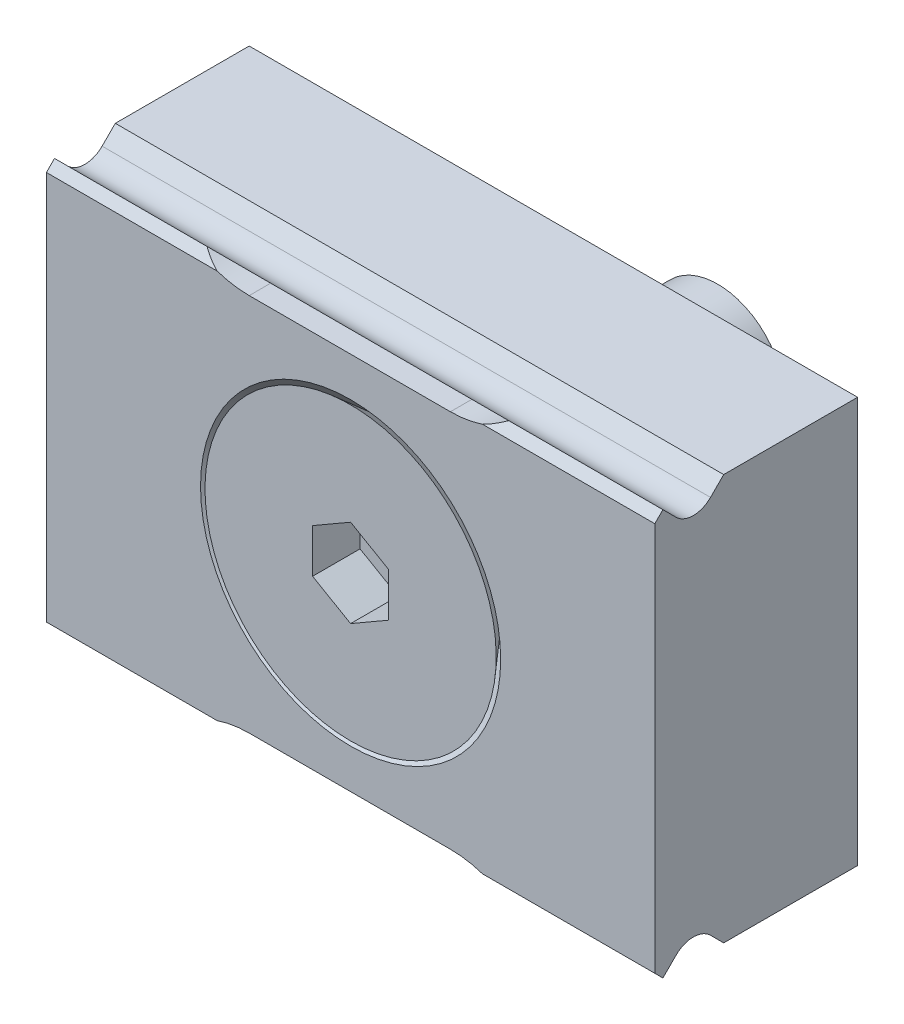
ISO-10303-21;
HEADER;
FILE_DESCRIPTION(('STEP AP214'),'2;1');
FILE_NAME('part.step','',(''),(''),'','','');
FILE_SCHEMA(('AUTOMOTIVE_DESIGN { 1 0 10303 214 1 1 1 1 }'));
ENDSEC;
DATA;
#1=APPLICATION_CONTEXT('core data for automotive mechanical design processes');
#2=APPLICATION_PROTOCOL_DEFINITION('international standard','automotive_design',2000,#1);
#3=PRODUCT_CONTEXT('',#1,'mechanical');
#4=PRODUCT('Part','Part','',(#3));
#5=PRODUCT_RELATED_PRODUCT_CATEGORY('part','',(#4));
#6=PRODUCT_DEFINITION_FORMATION('','',#4);
#7=PRODUCT_DEFINITION_CONTEXT('part definition',#1,'design');
#8=PRODUCT_DEFINITION('design','',#6,#7);
#9=PRODUCT_DEFINITION_SHAPE('','',#8);
#10=(LENGTH_UNIT() NAMED_UNIT(*) SI_UNIT(.MILLI.,.METRE.));
#11=(NAMED_UNIT(*) PLANE_ANGLE_UNIT() SI_UNIT($,.RADIAN.));
#12=(NAMED_UNIT(*) SI_UNIT($,.STERADIAN.) SOLID_ANGLE_UNIT());
#13=UNCERTAINTY_MEASURE_WITH_UNIT(LENGTH_MEASURE(1.E-05),#10,'distance_accuracy_value','');
#14=(GEOMETRIC_REPRESENTATION_CONTEXT(3) GLOBAL_UNCERTAINTY_ASSIGNED_CONTEXT((#13)) GLOBAL_UNIT_ASSIGNED_CONTEXT((#10,
#11,#12)) REPRESENTATION_CONTEXT('',''));
#15=CARTESIAN_POINT('',(0.,0.,0.));
#16=DIRECTION('',(0.,0.,1.));
#17=DIRECTION('',(1.,0.,0.));
#18=AXIS2_PLACEMENT_3D('',#15,#16,#17);
#19=CARTESIAN_POINT('',(0.,3.05311331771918E-13,31.75));
#20=DIRECTION('',(0.,0.,0.999999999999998));
#21=DIRECTION('',(0.,-1.,0.));
#22=AXIS2_PLACEMENT_3D('',#19,#20,#21);
#23=CYLINDRICAL_SURFACE('',#22,2.08280000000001);
#24=CARTESIAN_POINT('',(0.,0.,3.50111263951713));
#25=DIRECTION('',(0.,0.,0.999999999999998));
#26=DIRECTION('',(0.,-1.,0.));
#27=AXIS2_PLACEMENT_3D('',#24,#25,#26);
#28=CIRCLE('',#27,2.0828);
#29=CARTESIAN_POINT('',(0.,-2.08279999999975,3.50111263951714));
#30=VERTEX_POINT('',#29);
#31=EDGE_CURVE('P0_E25',#30,#30,#28,.T.);
#32=CARTESIAN_POINT('',(0.,0.,-5.14544487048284));
#33=DIRECTION('',(0.,0.,-0.999999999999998));
#34=DIRECTION('',(0.,1.,0.));
#35=AXIS2_PLACEMENT_3D('',#32,#33,#34);
#36=CIRCLE('',#35,2.08280000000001);
#37=CARTESIAN_POINT('',(0.,-2.08279999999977,-5.14544487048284));
#38=VERTEX_POINT('',#37);
#39=EDGE_CURVE('P0_E20',#38,#38,#36,.T.);
#40=CARTESIAN_POINT('',(0.,-2.08279999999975,3.50111263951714));
#41=CARTESIAN_POINT('',(0.,-2.08279999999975,3.4110443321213));
#42=CARTESIAN_POINT('',(0.,-2.08279999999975,3.32097602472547));
#43=CARTESIAN_POINT('',(0.,-2.08279999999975,3.14083940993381));
#44=CARTESIAN_POINT('',(0.,-2.08279999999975,3.05077110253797));
#45=CARTESIAN_POINT('',(0.,-2.08279999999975,2.87063448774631));
#46=CARTESIAN_POINT('',(0.,-2.08279999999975,2.78056618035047));
#47=CARTESIAN_POINT('',(0.,-2.08279999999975,2.60042956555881));
#48=CARTESIAN_POINT('',(0.,-2.08279999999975,2.51036125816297));
#49=CARTESIAN_POINT('',(0.,-2.08279999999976,2.33022464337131));
#50=CARTESIAN_POINT('',(0.,-2.08279999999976,2.24015633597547));
#51=CARTESIAN_POINT('',(0.,-2.08279999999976,2.06001972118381));
#52=CARTESIAN_POINT('',(0.,-2.08279999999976,1.96995141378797));
#53=CARTESIAN_POINT('',(0.,-2.08279999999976,1.78981479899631));
#54=CARTESIAN_POINT('',(0.,-2.08279999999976,1.69974649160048));
#55=CARTESIAN_POINT('',(0.,-2.08279999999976,1.51960987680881));
#56=CARTESIAN_POINT('',(0.,-2.08279999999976,1.42954156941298));
#57=CARTESIAN_POINT('',(0.,-2.08279999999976,1.24940495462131));
#58=CARTESIAN_POINT('',(0.,-2.08279999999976,1.15933664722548));
#59=CARTESIAN_POINT('',(0.,-2.08279999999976,0.979200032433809));
#60=CARTESIAN_POINT('',(0.,-2.08279999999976,0.889131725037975));
#61=CARTESIAN_POINT('',(0.,-2.08279999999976,0.708995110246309));
#62=CARTESIAN_POINT('',(0.,-2.08279999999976,0.618926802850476));
#63=CARTESIAN_POINT('',(0.,-2.08279999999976,0.438790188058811));
#64=CARTESIAN_POINT('',(0.,-2.08279999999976,0.348721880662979));
#65=CARTESIAN_POINT('',(0.,-2.08279999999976,0.168585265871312));
#66=CARTESIAN_POINT('',(0.,-2.08279999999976,0.0785169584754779));
#67=CARTESIAN_POINT('',(0.,-2.08279999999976,-0.101619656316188));
#68=CARTESIAN_POINT('',(0.,-2.08279999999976,-0.19168796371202));
#69=CARTESIAN_POINT('',(0.,-2.08279999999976,-0.371824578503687));
#70=CARTESIAN_POINT('',(0.,-2.08279999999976,-0.461892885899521));
#71=CARTESIAN_POINT('',(0.,-2.08279999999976,-0.64202950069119));
#72=CARTESIAN_POINT('',(0.,-2.08279999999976,-0.732097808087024));
#73=CARTESIAN_POINT('',(0.,-2.08279999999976,-0.912234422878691));
#74=CARTESIAN_POINT('',(0.,-2.08279999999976,-1.00230273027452));
#75=CARTESIAN_POINT('',(0.,-2.08279999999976,-1.18243934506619));
#76=CARTESIAN_POINT('',(0.,-2.08279999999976,-1.27250765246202));
#77=CARTESIAN_POINT('',(0.,-2.08279999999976,-1.45264426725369));
#78=CARTESIAN_POINT('',(0.,-2.08279999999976,-1.54271257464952));
#79=CARTESIAN_POINT('',(0.,-2.08279999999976,-1.72284918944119));
#80=CARTESIAN_POINT('',(0.,-2.08279999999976,-1.81291749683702));
#81=CARTESIAN_POINT('',(0.,-2.08279999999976,-1.99305411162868));
#82=CARTESIAN_POINT('',(0.,-2.08279999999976,-2.08312241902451));
#83=CARTESIAN_POINT('',(0.,-2.08279999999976,-2.26325903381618));
#84=CARTESIAN_POINT('',(0.,-2.08279999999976,-2.35332734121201));
#85=CARTESIAN_POINT('',(0.,-2.08279999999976,-2.53346395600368));
#86=CARTESIAN_POINT('',(0.,-2.08279999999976,-2.62353226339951));
#87=CARTESIAN_POINT('',(0.,-2.08279999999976,-2.80366887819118));
#88=CARTESIAN_POINT('',(0.,-2.08279999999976,-2.89373718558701));
#89=CARTESIAN_POINT('',(0.,-2.08279999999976,-3.07387380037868));
#90=CARTESIAN_POINT('',(0.,-2.08279999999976,-3.16394210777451));
#91=CARTESIAN_POINT('',(0.,-2.08279999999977,-3.34407872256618));
#92=CARTESIAN_POINT('',(0.,-2.08279999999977,-3.43414702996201));
#93=CARTESIAN_POINT('',(0.,-2.08279999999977,-3.61428364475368));
#94=CARTESIAN_POINT('',(0.,-2.08279999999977,-3.70435195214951));
#95=CARTESIAN_POINT('',(0.,-2.08279999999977,-3.88448856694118));
#96=CARTESIAN_POINT('',(0.,-2.08279999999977,-3.97455687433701));
#97=CARTESIAN_POINT('',(0.,-2.08279999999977,-4.15469348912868));
#98=CARTESIAN_POINT('',(0.,-2.08279999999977,-4.24476179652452));
#99=CARTESIAN_POINT('',(0.,-2.08279999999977,-4.42489841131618));
#100=CARTESIAN_POINT('',(0.,-2.08279999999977,-4.51496671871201));
#101=CARTESIAN_POINT('',(0.,-2.08279999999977,-4.69510333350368));
#102=CARTESIAN_POINT('',(0.,-2.08279999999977,-4.78517164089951));
#103=CARTESIAN_POINT('',(0.,-2.08279999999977,-4.96530825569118));
#104=CARTESIAN_POINT('',(0.,-2.08279999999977,-5.05537656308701));
#105=CARTESIAN_POINT('',(0.,-2.08279999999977,-5.14544487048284));
#106=B_SPLINE_CURVE_WITH_KNOTS('',3,(#40,#41,#42,#43,#44,#45,#46,#47,#48,#49,#50,#51,#52,#53,
#54,#55,#56,#57,#58,#59,#60,#61,#62,#63,#64,#65,#66,#67,#68,#69,#70,#71,#72,#73,#74,#75,#76,#77,
#78,#79,#80,#81,#82,#83,#84,#85,#86,#87,#88,#89,#90,#91,#92,#93,#94,#95,#96,#97,#98,#99,#100,
#101,#102,#103,#104,#105),.UNSPECIFIED.,.F.,.F.,(4,2,2,2,2,2,2,2,2,2,2,2,2,2,2,2,2,2,2,2,2,2,2,
2,2,2,2,2,2,2,2,2,4),(0.,0.2702049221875,0.540409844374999,0.810614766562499,1.08081968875,
1.3510246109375,1.621229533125,1.89143445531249,2.16163937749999,2.4318442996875,2.702049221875,
2.9722541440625,3.24245906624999,3.51266398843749,3.78286891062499,4.05307383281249,4.323278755,
4.59348367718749,4.86368859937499,5.13389352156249,5.40409844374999,5.67430336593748,
5.94450828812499,6.21471321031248,6.48491813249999,6.75512305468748,7.02532797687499,
7.29553289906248,7.56573782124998,7.83594274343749,8.10614766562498,8.37635258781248,
8.64655750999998),.UNSPECIFIED.);
#107=EDGE_CURVE('P0_BSEAM16',#30,#38,#106,.T.);
#108=ORIENTED_EDGE('',*,*,#31,.F.);
#109=ORIENTED_EDGE('',*,*,#39,.F.);
#110=ORIENTED_EDGE('',*,*,#107,.T.);
#111=ORIENTED_EDGE('',*,*,#107,.F.);
#112=EDGE_LOOP('',(#108,#110,#109,#111));
#113=FACE_BOUND('',#112,.T.);
#114=ADVANCED_FACE('P0_F16',(#113),#23,.T.);
#115=CARTESIAN_POINT('',(0.,0.,6.34999999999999));
#116=DIRECTION('',(0.,0.,0.999999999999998));
#117=DIRECTION('',(0.,-1.,0.));
#118=AXIS2_PLACEMENT_3D('',#115,#116,#117);
#119=PLANE('',#118);
#120=DIRECTION('',(0.,-1.,0.));
#121=VECTOR('',#120,1.);
#122=CARTESIAN_POINT('',(-1.190625,0.687407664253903,6.35));
#123=LINE('',#122,#121);
#124=CARTESIAN_POINT('',(-1.190625,0.687407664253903,6.35));
#125=VERTEX_POINT('',#124);
#126=CARTESIAN_POINT('',(-1.19062499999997,-0.687407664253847,6.34999999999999));
#127=VERTEX_POINT('',#126);
#128=EDGE_CURVE('P0_E32',#125,#127,#123,.T.);
#129=ORIENTED_EDGE('',*,*,#128,.F.);
#130=DIRECTION('',(-0.866025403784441,-0.499999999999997,0.));
#131=VECTOR('',#130,1.);
#132=CARTESIAN_POINT('',(0.,1.37481532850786,6.34999999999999));
#133=LINE('',#132,#131);
#134=CARTESIAN_POINT('',(0.,1.37481532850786,6.34999999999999));
#135=VERTEX_POINT('',#134);
#136=EDGE_CURVE('P0_E130',#135,#125,#133,.T.);
#137=ORIENTED_EDGE('',*,*,#136,.F.);
#138=DIRECTION('',(0.866025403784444,-0.500000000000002,0.));
#139=VECTOR('',#138,1.);
#140=CARTESIAN_POINT('',(0.,1.37481532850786,6.34999999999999));
#141=LINE('',#140,#139);
#142=CARTESIAN_POINT('',(1.19062500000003,0.687407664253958,6.34999999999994));
#143=VERTEX_POINT('',#142);
#144=EDGE_CURVE('P0_E128',#135,#143,#141,.T.);
#145=ORIENTED_EDGE('',*,*,#144,.T.);
#146=DIRECTION('',(0.,-1.,0.));
#147=VECTOR('',#146,1.);
#148=CARTESIAN_POINT('',(1.19062500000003,0.687407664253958,6.34999999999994));
#149=LINE('',#148,#147);
#150=CARTESIAN_POINT('',(1.19062500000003,-0.687407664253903,6.34999999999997));
#151=VERTEX_POINT('',#150);
#152=EDGE_CURVE('P0_E98',#143,#151,#149,.T.);
#153=ORIENTED_EDGE('',*,*,#152,.T.);
#154=DIRECTION('',(0.866025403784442,0.499999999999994,0.));
#155=VECTOR('',#154,1.);
#156=CARTESIAN_POINT('',(0.,-1.37481532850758,6.34999999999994));
#157=LINE('',#156,#155);
#158=CARTESIAN_POINT('',(0.,-1.37481532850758,6.34999999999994));
#159=VERTEX_POINT('',#158);
#160=EDGE_CURVE('P0_E123',#159,#151,#157,.T.);
#161=ORIENTED_EDGE('',*,*,#160,.F.);
#162=DIRECTION('',(-0.866025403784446,0.499999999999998,0.));
#163=VECTOR('',#162,1.);
#164=CARTESIAN_POINT('',(0.,-1.37481532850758,6.34999999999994));
#165=LINE('',#164,#163);
#166=EDGE_CURVE('P0_E119',#159,#127,#165,.T.);
#167=ORIENTED_EDGE('',*,*,#166,.T.);
#168=EDGE_LOOP('',(#129,#137,#145,#153,#161,#167));
#169=FACE_BOUND('',#168,.T.);
#170=CARTESIAN_POINT('',(0.,0.,6.34999999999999));
#171=DIRECTION('',(0.,0.,0.999999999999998));
#172=DIRECTION('',(0.,-1.,0.));
#173=AXIS2_PLACEMENT_3D('',#170,#171,#172);
#174=CIRCLE('',#173,4.5593);
#175=CARTESIAN_POINT('',(0.,-4.55930000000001,6.35));
#176=VERTEX_POINT('',#175);
#177=EDGE_CURVE('P0_E11',#176,#176,#174,.T.);
#178=ORIENTED_EDGE('',*,*,#177,.T.);
#179=EDGE_LOOP('',(#178));
#180=FACE_BOUND('',#179,.T.);
#181=ADVANCED_FACE('P0_F149',(#169,#180),#119,.T.);
#182=CARTESIAN_POINT('',(0.,0.,3.50111263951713));
#183=DIRECTION('',(0.,0.,0.999999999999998));
#184=DIRECTION('',(0.,-1.,0.));
#185=AXIS2_PLACEMENT_3D('',#182,#183,#184);
#186=CONICAL_SURFACE('',#185,2.0828,0.715584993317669);
#187=CARTESIAN_POINT('',(0.,-4.55930000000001,6.35));
#188=CARTESIAN_POINT('',(0.,-4.53350312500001,6.32032408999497));
#189=CARTESIAN_POINT('',(0.,-4.50770625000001,6.29064817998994));
#190=CARTESIAN_POINT('',(0.,-4.45611250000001,6.23129635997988));
#191=CARTESIAN_POINT('',(0.,-4.43031562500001,6.20162044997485));
#192=CARTESIAN_POINT('',(0.,-4.37872187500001,6.14226862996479));
#193=CARTESIAN_POINT('',(0.,-4.35292500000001,6.11259271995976));
#194=CARTESIAN_POINT('',(0.,-4.30133125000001,6.0532408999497));
#195=CARTESIAN_POINT('',(0.,-4.27553437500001,6.02356498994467));
#196=CARTESIAN_POINT('',(0.,-4.22394062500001,5.96421316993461));
#197=CARTESIAN_POINT('',(0.,-4.19814375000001,5.93453725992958));
#198=CARTESIAN_POINT('',(0.,-4.14655000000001,5.87518543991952));
#199=CARTESIAN_POINT('',(0.,-4.12075312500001,5.84550952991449));
#200=CARTESIAN_POINT('',(0.,-4.06915937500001,5.78615770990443));
#201=CARTESIAN_POINT('',(0.,-4.04336250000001,5.7564817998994));
#202=CARTESIAN_POINT('',(0.,-3.99176875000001,5.69712997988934));
#203=CARTESIAN_POINT('',(0.,-3.96597187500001,5.66745406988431));
#204=CARTESIAN_POINT('',(0.,-3.91437812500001,5.60810224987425));
#205=CARTESIAN_POINT('',(0.,-3.88858125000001,5.57842633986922));
#206=CARTESIAN_POINT('',(0.,-3.83698750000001,5.51907451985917));
#207=CARTESIAN_POINT('',(0.,-3.81119062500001,5.48939860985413));
#208=CARTESIAN_POINT('',(0.,-3.75959687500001,5.43004678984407));
#209=CARTESIAN_POINT('',(0.,-3.73380000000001,5.40037087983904));
#210=CARTESIAN_POINT('',(0.,-3.68220625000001,5.34101905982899));
#211=CARTESIAN_POINT('',(0.,-3.65640937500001,5.31134314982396));
#212=CARTESIAN_POINT('',(0.,-3.60481562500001,5.25199132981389));
#213=CARTESIAN_POINT('',(0.,-3.57901875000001,5.22231541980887));
#214=CARTESIAN_POINT('',(0.,-3.52742500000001,5.16296359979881));
#215=CARTESIAN_POINT('',(0.,-3.50162812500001,5.13328768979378));
#216=CARTESIAN_POINT('',(0.,-3.45003437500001,5.07393586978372));
#217=CARTESIAN_POINT('',(0.,-3.42423750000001,5.04425995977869));
#218=CARTESIAN_POINT('',(0.,-3.37264375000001,4.98490813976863));
#219=CARTESIAN_POINT('',(0.,-3.34684687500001,4.9552322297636));
#220=CARTESIAN_POINT('',(0.,-3.29525312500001,4.89588040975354));
#221=CARTESIAN_POINT('',(0.,-3.26945625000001,4.86620449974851));
#222=CARTESIAN_POINT('',(0.,-3.21786250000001,4.80685267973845));
#223=CARTESIAN_POINT('',(0.,-3.19206562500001,4.77717676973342));
#224=CARTESIAN_POINT('',(0.,-3.14047187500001,4.71782494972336));
#225=CARTESIAN_POINT('',(0.,-3.11467500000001,4.68814903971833));
#226=CARTESIAN_POINT('',(0.,-3.06308125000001,4.62879721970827));
#227=CARTESIAN_POINT('',(0.,-3.03728437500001,4.59912130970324));
#228=CARTESIAN_POINT('',(0.,-2.98569062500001,4.53976948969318));
#229=CARTESIAN_POINT('',(0.,-2.95989375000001,4.51009357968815));
#230=CARTESIAN_POINT('',(0.,-2.90830000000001,4.45074175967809));
#231=CARTESIAN_POINT('',(0.,-2.88250312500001,4.42106584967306));
#232=CARTESIAN_POINT('',(0.,-2.83090937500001,4.361714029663));
#233=CARTESIAN_POINT('',(0.,-2.80511250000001,4.33203811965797));
#234=CARTESIAN_POINT('',(0.,-2.75351875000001,4.27268629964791));
#235=CARTESIAN_POINT('',(0.,-2.72772187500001,4.24301038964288));
#236=CARTESIAN_POINT('',(0.,-2.67612812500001,4.18365856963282));
#237=CARTESIAN_POINT('',(0.,-2.65033125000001,4.15398265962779));
#238=CARTESIAN_POINT('',(0.,-2.59873750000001,4.09463083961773));
#239=CARTESIAN_POINT('',(0.,-2.57294062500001,4.0649549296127));
#240=CARTESIAN_POINT('',(0.,-2.52134687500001,4.00560310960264));
#241=CARTESIAN_POINT('',(0.,-2.49555000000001,3.97592719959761));
#242=CARTESIAN_POINT('',(0.,-2.44395625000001,3.91657537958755));
#243=CARTESIAN_POINT('',(0.,-2.41815937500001,3.88689946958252));
#244=CARTESIAN_POINT('',(0.,-2.36656562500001,3.82754764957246));
#245=CARTESIAN_POINT('',(0.,-2.34076875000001,3.79787173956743));
#246=CARTESIAN_POINT('',(0.,-2.28917500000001,3.73851991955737));
#247=CARTESIAN_POINT('',(0.,-2.26337812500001,3.70884400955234));
#248=CARTESIAN_POINT('',(0.,-2.21178437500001,3.64949218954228));
#249=CARTESIAN_POINT('',(0.,-2.18598750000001,3.61981627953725));
#250=CARTESIAN_POINT('',(0.,-2.13439375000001,3.5604644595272));
#251=CARTESIAN_POINT('',(0.,-2.10859687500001,3.53078854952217));
#252=CARTESIAN_POINT('',(0.,-2.08280000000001,3.50111263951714));
#253=B_SPLINE_CURVE_WITH_KNOTS('',3,(#187,#188,#189,#190,#191,#192,#193,#194,#195,#196,#197,
#198,#199,#200,#201,#202,#203,#204,#205,#206,#207,#208,#209,#210,#211,#212,#213,#214,#215,#216,
#217,#218,#219,#220,#221,#222,#223,#224,#225,#226,#227,#228,#229,#230,#231,#232,#233,#234,#235,
#236,#237,#238,#239,#240,#241,#242,#243,#244,#245,#246,#247,#248,#249,#250,#251,#252),
.UNSPECIFIED.,.F.,.F.,(4,2,2,2,2,2,2,2,2,2,2,2,2,2,2,2,2,2,2,2,2,2,2,2,2,2,2,2,2,2,2,2,4),(0.,
0.117962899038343,0.235925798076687,0.35388869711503,0.471851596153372,0.589814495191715,
0.707777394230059,0.825740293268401,0.943703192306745,1.06166609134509,1.17962899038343,
1.29759188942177,1.41555478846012,1.53351768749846,1.6514805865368,1.76944348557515,
1.88740638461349,2.00536928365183,2.12333218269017,2.24129508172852,2.35925798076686,
2.4772208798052,2.59518377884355,2.71314667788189,2.83110957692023,2.94907247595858,
3.06703537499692,3.18499827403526,3.30296117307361,3.42092407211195,3.53888697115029,
3.65684987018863,3.77481276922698),.UNSPECIFIED.);
#254=EDGE_CURVE('P0_BSEAM145',#176,#30,#253,.T.);
#255=ORIENTED_EDGE('',*,*,#177,.F.);
#256=ORIENTED_EDGE('',*,*,#31,.T.);
#257=ORIENTED_EDGE('',*,*,#254,.T.);
#258=ORIENTED_EDGE('',*,*,#254,.F.);
#259=EDGE_LOOP('',(#255,#257,#256,#258));
#260=FACE_BOUND('',#259,.T.);
#261=ADVANCED_FACE('P0_F145',(#260),#186,.T.);
#262=CARTESIAN_POINT('',(-1.19062500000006,0.687407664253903,4.86410000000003));
#263=DIRECTION('',(-1.,0.,0.));
#264=DIRECTION('',(0.,-1.,0.));
#265=AXIS2_PLACEMENT_3D('',#262,#263,#264);
#266=PLANE('',#265);
#267=ORIENTED_EDGE('',*,*,#128,.T.);
#268=DIRECTION('',(0.,0.,0.999999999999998));
#269=VECTOR('',#268,1.);
#270=CARTESIAN_POINT('',(-1.19062500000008,-0.687407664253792,4.86410000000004));
#271=LINE('',#270,#269);
#272=CARTESIAN_POINT('',(-1.19062500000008,-0.687407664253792,4.86410000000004));
#273=VERTEX_POINT('',#272);
#274=EDGE_CURVE('P0_E117',#273,#127,#271,.T.);
#275=ORIENTED_EDGE('',*,*,#274,.F.);
#276=DIRECTION('',(0.,-1.,0.));
#277=VECTOR('',#276,1.);
#278=CARTESIAN_POINT('',(-1.19062500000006,0.687407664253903,4.86410000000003));
#279=LINE('',#278,#277);
#280=CARTESIAN_POINT('',(-1.19062500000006,0.687407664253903,4.86410000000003));
#281=VERTEX_POINT('',#280);
#282=EDGE_CURVE('P0_E132',#281,#273,#279,.T.);
#283=ORIENTED_EDGE('',*,*,#282,.F.);
#284=DIRECTION('',(0.,0.,0.999999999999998));
#285=VECTOR('',#284,1.);
#286=CARTESIAN_POINT('',(-1.19062500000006,0.687407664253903,4.86410000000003));
#287=LINE('',#286,#285);
#288=EDGE_CURVE('P0_E40',#281,#125,#287,.T.);
#289=ORIENTED_EDGE('',*,*,#288,.T.);
#290=EDGE_LOOP('',(#267,#275,#283,#289));
#291=FACE_BOUND('',#290,.T.);
#292=ADVANCED_FACE('P0_F173',(#291),#266,.F.);
#293=CARTESIAN_POINT('',(0.,1.37481532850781,4.86410000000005));
#294=DIRECTION('',(-0.500000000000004,0.86602540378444,0.));
#295=DIRECTION('',(-0.866025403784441,-0.499999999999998,0.));
#296=AXIS2_PLACEMENT_3D('',#293,#294,#295);
#297=PLANE('',#296);
#298=ORIENTED_EDGE('',*,*,#136,.T.);
#299=ORIENTED_EDGE('',*,*,#288,.F.);
#300=DIRECTION('',(-0.866025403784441,-0.499999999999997,0.));
#301=VECTOR('',#300,1.);
#302=CARTESIAN_POINT('',(0.,1.37481532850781,4.86410000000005));
#303=LINE('',#302,#301);
#304=CARTESIAN_POINT('',(0.,1.37481532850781,4.86410000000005));
#305=VERTEX_POINT('',#304);
#306=EDGE_CURVE('P0_E91',#305,#281,#303,.T.);
#307=ORIENTED_EDGE('',*,*,#306,.F.);
#308=DIRECTION('',(0.,0.,0.999999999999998));
#309=VECTOR('',#308,1.);
#310=CARTESIAN_POINT('',(0.,1.37481532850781,4.86410000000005));
#311=LINE('',#310,#309);
#312=EDGE_CURVE('P0_E86',#305,#135,#311,.T.);
#313=ORIENTED_EDGE('',*,*,#312,.T.);
#314=EDGE_LOOP('',(#298,#299,#307,#313));
#315=FACE_BOUND('',#314,.T.);
#316=ADVANCED_FACE('P0_F170',(#315),#297,.F.);
#317=CARTESIAN_POINT('',(0.,1.37481532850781,4.86410000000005));
#318=DIRECTION('',(-0.5,-0.866025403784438,0.));
#319=DIRECTION('',(0.866025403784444,-0.500000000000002,0.));
#320=AXIS2_PLACEMENT_3D('',#317,#318,#319);
#321=PLANE('',#320);
#322=ORIENTED_EDGE('',*,*,#144,.F.);
#323=ORIENTED_EDGE('',*,*,#312,.F.);
#324=DIRECTION('',(0.866025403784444,-0.500000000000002,0.));
#325=VECTOR('',#324,1.);
#326=CARTESIAN_POINT('',(0.,1.37481532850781,4.86410000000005));
#327=LINE('',#326,#325);
#328=CARTESIAN_POINT('',(1.19062499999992,0.687407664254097,4.86410000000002));
#329=VERTEX_POINT('',#328);
#330=EDGE_CURVE('P0_E80',#305,#329,#327,.T.);
#331=ORIENTED_EDGE('',*,*,#330,.T.);
#332=DIRECTION('',(0.,0.,0.999999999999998));
#333=VECTOR('',#332,1.);
#334=CARTESIAN_POINT('',(1.19062499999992,0.687407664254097,4.86410000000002));
#335=LINE('',#334,#333);
#336=EDGE_CURVE('P0_E84',#329,#143,#335,.T.);
#337=ORIENTED_EDGE('',*,*,#336,.T.);
#338=EDGE_LOOP('',(#322,#323,#331,#337));
#339=FACE_BOUND('',#338,.T.);
#340=ADVANCED_FACE('P0_F83',(#339),#321,.T.);
#341=CARTESIAN_POINT('',(1.19062499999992,0.687407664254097,4.86410000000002));
#342=DIRECTION('',(-1.,0.,0.));
#343=DIRECTION('',(0.,-1.,0.));
#344=AXIS2_PLACEMENT_3D('',#341,#342,#343);
#345=PLANE('',#344);
#346=ORIENTED_EDGE('',*,*,#152,.F.);
#347=ORIENTED_EDGE('',*,*,#336,.F.);
#348=DIRECTION('',(0.,-1.,0.));
#349=VECTOR('',#348,1.);
#350=CARTESIAN_POINT('',(1.19062499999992,0.687407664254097,4.86410000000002));
#351=LINE('',#350,#349);
#352=CARTESIAN_POINT('',(1.19062499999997,-0.687407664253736,4.8641));
#353=VERTEX_POINT('',#352);
#354=EDGE_CURVE('P0_E92',#329,#353,#351,.T.);
#355=ORIENTED_EDGE('',*,*,#354,.T.);
#356=DIRECTION('',(0.,0.,0.999999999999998));
#357=VECTOR('',#356,1.);
#358=CARTESIAN_POINT('',(1.19062499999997,-0.687407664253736,4.8641));
#359=LINE('',#358,#357);
#360=EDGE_CURVE('P0_E101',#353,#151,#359,.T.);
#361=ORIENTED_EDGE('',*,*,#360,.T.);
#362=EDGE_LOOP('',(#346,#347,#355,#361));
#363=FACE_BOUND('',#362,.T.);
#364=ADVANCED_FACE('P0_F95',(#363),#345,.T.);
#365=CARTESIAN_POINT('',(0.,-1.37481532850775,4.86410000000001));
#366=DIRECTION('',(0.5,-0.866025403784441,0.));
#367=DIRECTION('',(0.866025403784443,0.499999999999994,0.));
#368=AXIS2_PLACEMENT_3D('',#365,#366,#367);
#369=PLANE('',#368);
#370=ORIENTED_EDGE('',*,*,#160,.T.);
#371=ORIENTED_EDGE('',*,*,#360,.F.);
#372=DIRECTION('',(0.866025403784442,0.499999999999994,0.));
#373=VECTOR('',#372,1.);
#374=CARTESIAN_POINT('',(0.,-1.37481532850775,4.86410000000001));
#375=LINE('',#374,#373);
#376=CARTESIAN_POINT('',(0.,-1.37481532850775,4.86410000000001));
#377=VERTEX_POINT('',#376);
#378=EDGE_CURVE('P0_E107',#377,#353,#375,.T.);
#379=ORIENTED_EDGE('',*,*,#378,.F.);
#380=DIRECTION('',(0.,0.,0.999999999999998));
#381=VECTOR('',#380,1.);
#382=CARTESIAN_POINT('',(0.,-1.37481532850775,4.86410000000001));
#383=LINE('',#382,#381);
#384=EDGE_CURVE('P0_E136',#377,#159,#383,.T.);
#385=ORIENTED_EDGE('',*,*,#384,.T.);
#386=EDGE_LOOP('',(#370,#371,#379,#385));
#387=FACE_BOUND('',#386,.T.);
#388=ADVANCED_FACE('P0_F167',(#387),#369,.F.);
#389=CARTESIAN_POINT('',(0.,-1.37481532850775,4.86410000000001));
#390=DIRECTION('',(0.499999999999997,0.86602540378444,0.));
#391=DIRECTION('',(-0.866025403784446,0.499999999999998,0.));
#392=AXIS2_PLACEMENT_3D('',#389,#390,#391);
#393=PLANE('',#392);
#394=ORIENTED_EDGE('',*,*,#166,.F.);
#395=ORIENTED_EDGE('',*,*,#384,.F.);
#396=DIRECTION('',(-0.866025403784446,0.499999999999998,0.));
#397=VECTOR('',#396,1.);
#398=CARTESIAN_POINT('',(0.,-1.37481532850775,4.86410000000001));
#399=LINE('',#398,#397);
#400=EDGE_CURVE('P0_E71',#377,#273,#399,.T.);
#401=ORIENTED_EDGE('',*,*,#400,.T.);
#402=ORIENTED_EDGE('',*,*,#274,.T.);
#403=EDGE_LOOP('',(#394,#395,#401,#402));
#404=FACE_BOUND('',#403,.T.);
#405=ADVANCED_FACE('P0_F162',(#404),#393,.T.);
#406=CARTESIAN_POINT('',(-1.19062500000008,-0.687407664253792,4.86410000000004));
#407=DIRECTION('',(0.,0.,-0.999999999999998));
#408=DIRECTION('',(0.,1.,0.));
#409=AXIS2_PLACEMENT_3D('',#406,#407,#408);
#410=PLANE('',#409);
#411=ORIENTED_EDGE('',*,*,#282,.T.);
#412=ORIENTED_EDGE('',*,*,#400,.F.);
#413=ORIENTED_EDGE('',*,*,#378,.T.);
#414=ORIENTED_EDGE('',*,*,#354,.F.);
#415=ORIENTED_EDGE('',*,*,#330,.F.);
#416=ORIENTED_EDGE('',*,*,#306,.T.);
#417=EDGE_LOOP('',(#411,#412,#413,#414,#415,#416));
#418=FACE_BOUND('',#417,.T.);
#419=ADVANCED_FACE('P0_F105',(#418),#410,.F.);
#420=CARTESIAN_POINT('',(0.,0.,-5.14544487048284));
#421=DIRECTION('',(0.,0.,-0.999999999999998));
#422=DIRECTION('',(0.,1.,0.));
#423=AXIS2_PLACEMENT_3D('',#420,#421,#422);
#424=PLANE('',#423);
#425=ORIENTED_EDGE('',*,*,#39,.T.);
#426=EDGE_LOOP('',(#425));
#427=FACE_BOUND('',#426,.T.);
#428=ADVANCED_FACE('P0_F18',(#427),#424,.T.);
#429=CLOSED_SHELL('',(#114,#181,#261,#292,#316,#340,#364,#388,#405,#419,#428));
#430=MANIFOLD_SOLID_BREP('P0_B1',#429);
#431=CARTESIAN_POINT('',(9.52500000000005,-6.47589266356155,5.14426193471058));
#432=DIRECTION('',(1.,0.,0.));
#433=DIRECTION('',(0.,0.,-0.999999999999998));
#434=AXIS2_PLACEMENT_3D('',#431,#432,#433);
#435=PLANE('',#434);
#436=DIRECTION('',(0.,0.707106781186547,0.707106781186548));
#437=VECTOR('',#436,1.);
#438=CARTESIAN_POINT('',(9.52500000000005,-5.93707729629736,4.60544656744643));
#439=LINE('',#438,#437);
#440=CARTESIAN_POINT('',(9.52500000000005,-6.34999999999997,4.1925238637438));
#441=VERTEX_POINT('',#440);
#442=CARTESIAN_POINT('',(9.52500000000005,-5.93707729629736,4.60544656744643));
#443=VERTEX_POINT('',#442);
#444=EDGE_CURVE('P1_E310',#441,#443,#439,.T.);
#445=ORIENTED_EDGE('',*,*,#444,.F.);
#446=DIRECTION('',(0.,0.,-0.999999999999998));
#447=VECTOR('',#446,1.);
#448=CARTESIAN_POINT('',(9.52500000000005,-6.35000000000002,5.14426193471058));
#449=LINE('',#448,#447);
#450=CARTESIAN_POINT('',(9.5250000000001,-6.35000000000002,0.));
#451=VERTEX_POINT('',#450);
#452=EDGE_CURVE('P1_E37',#441,#451,#449,.T.);
#453=ORIENTED_EDGE('',*,*,#452,.T.);
#454=DIRECTION('',(0.,0.999999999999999,0.));
#455=VECTOR('',#454,1.);
#456=CARTESIAN_POINT('',(9.52500000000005,-6.47589266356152,0.));
#457=LINE('',#456,#455);
#458=CARTESIAN_POINT('',(9.52500000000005,6.35000000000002,0.));
#459=VERTEX_POINT('',#458);
#460=EDGE_CURVE('P1_E401',#451,#459,#457,.T.);
#461=ORIENTED_EDGE('',*,*,#460,.T.);
#462=DIRECTION('',(0.,0.,-0.999999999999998));
#463=VECTOR('',#462,1.);
#464=CARTESIAN_POINT('',(9.52500000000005,6.34999999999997,5.14426193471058));
#465=LINE('',#464,#463);
#466=CARTESIAN_POINT('',(9.52499999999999,6.35000000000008,4.19252386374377));
#467=VERTEX_POINT('',#466);
#468=EDGE_CURVE('P1_E407',#467,#459,#465,.T.);
#469=ORIENTED_EDGE('',*,*,#468,.F.);
#470=DIRECTION('',(0.,-0.707106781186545,0.707106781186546));
#471=VECTOR('',#470,1.);
#472=CARTESIAN_POINT('',(9.52500000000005,-0.538815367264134,11.0813392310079));
#473=LINE('',#472,#471);
#474=CARTESIAN_POINT('',(9.52500000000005,5.93707729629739,4.60544656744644));
#475=VERTEX_POINT('',#474);
#476=EDGE_CURVE('P1_E410',#467,#475,#473,.T.);
#477=ORIENTED_EDGE('',*,*,#476,.T.);
#478=CARTESIAN_POINT('',(9.52499999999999,6.47589266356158,5.14426193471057));
#479=DIRECTION('',(1.,0.,0.));
#480=DIRECTION('',(0.,0.,-0.999999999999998));
#481=AXIS2_PLACEMENT_3D('',#478,#479,#480);
#482=CIRCLE('',#481,0.762);
#483=CARTESIAN_POINT('',(9.52500000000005,5.93707729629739,5.68307730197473));
#484=VERTEX_POINT('',#483);
#485=EDGE_CURVE('P1_E412',#484,#475,#482,.T.);
#486=ORIENTED_EDGE('',*,*,#485,.F.);
#487=DIRECTION('',(0.,-0.707106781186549,-0.707106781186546));
#488=VECTOR('',#487,1.);
#489=CARTESIAN_POINT('',(9.52500000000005,-0.538815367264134,-0.792815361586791));
#490=LINE('',#489,#488);
#491=CARTESIAN_POINT('',(9.52500000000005,6.34999999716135,6.09600000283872));
#492=VERTEX_POINT('',#491);
#493=EDGE_CURVE('P1_E418',#492,#484,#490,.T.);
#494=ORIENTED_EDGE('',*,*,#493,.F.);
#495=DIRECTION('',(0.,0.707106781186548,-0.707106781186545));
#496=VECTOR('',#495,1.);
#497=CARTESIAN_POINT('',(9.52500000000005,0.412922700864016,12.0330772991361));
#498=LINE('',#497,#496);
#499=CARTESIAN_POINT('',(9.52500000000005,6.09599999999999,6.35000000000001));
#500=VERTEX_POINT('',#499);
#501=EDGE_CURVE('P1_E420',#500,#492,#498,.T.);
#502=ORIENTED_EDGE('',*,*,#501,.F.);
#503=DIRECTION('',(0.,0.999999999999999,0.));
#504=VECTOR('',#503,1.);
#505=CARTESIAN_POINT('',(9.52500000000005,-6.47589266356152,6.35000000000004));
#506=LINE('',#505,#504);
#507=CARTESIAN_POINT('',(9.5250000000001,-6.09599999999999,6.35));
#508=VERTEX_POINT('',#507);
#509=EDGE_CURVE('P1_E390',#508,#500,#506,.T.);
#510=ORIENTED_EDGE('',*,*,#509,.F.);
#511=DIRECTION('',(0.,-0.70710678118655,-0.707106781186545));
#512=VECTOR('',#511,1.);
#513=CARTESIAN_POINT('',(9.52500000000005,-6.88881536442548,5.55718463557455));
#514=LINE('',#513,#512);
#515=CARTESIAN_POINT('',(9.52500000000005,-6.34999999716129,6.09600000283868));
#516=VERTEX_POINT('',#515);
#517=EDGE_CURVE('P1_E388',#508,#516,#514,.T.);
#518=ORIENTED_EDGE('',*,*,#517,.T.);
#519=DIRECTION('',(0.,0.707106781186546,-0.707106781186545));
#520=VECTOR('',#519,1.);
#521=CARTESIAN_POINT('',(9.52500000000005,-5.93707729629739,5.68307730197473));
#522=LINE('',#521,#520);
#523=CARTESIAN_POINT('',(9.52500000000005,-5.93707729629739,5.68307730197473));
#524=VERTEX_POINT('',#523);
#525=EDGE_CURVE('P1_E383',#516,#524,#522,.T.);
#526=ORIENTED_EDGE('',*,*,#525,.T.);
#527=CARTESIAN_POINT('',(9.52500000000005,-6.47589266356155,5.14426193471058));
#528=DIRECTION('',(1.,0.,0.));
#529=DIRECTION('',(0.,0.,-0.999999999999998));
#530=AXIS2_PLACEMENT_3D('',#527,#528,#529);
#531=CIRCLE('',#530,0.762);
#532=EDGE_CURVE('P1_E313',#443,#524,#531,.T.);
#533=ORIENTED_EDGE('',*,*,#532,.F.);
#534=EDGE_LOOP('',(#445,#453,#461,#469,#477,#486,#494,#502,#510,#518,#526,#533));
#535=FACE_BOUND('',#534,.T.);
#536=ADVANCED_FACE('P1_F18',(#535),#435,.T.);
#537=CARTESIAN_POINT('',(-9.52500000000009,-6.47589266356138,5.14426193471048));
#538=DIRECTION('',(1.,0.,0.));
#539=DIRECTION('',(0.,0.,-0.999999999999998));
#540=AXIS2_PLACEMENT_3D('',#537,#538,#539);
#541=PLANE('',#540);
#542=DIRECTION('',(0.,-0.70710678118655,-0.707106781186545));
#543=VECTOR('',#542,1.);
#544=CARTESIAN_POINT('',(-9.52500000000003,-6.88881536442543,5.55718463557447));
#545=LINE('',#544,#543);
#546=CARTESIAN_POINT('',(-9.52499999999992,-6.09599999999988,6.34999999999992));
#547=VERTEX_POINT('',#546);
#548=CARTESIAN_POINT('',(-9.52500000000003,-6.34999999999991,6.09600000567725));
#549=VERTEX_POINT('',#548);
#550=EDGE_CURVE('P1_E244',#547,#549,#545,.T.);
#551=ORIENTED_EDGE('',*,*,#550,.F.);
#552=DIRECTION('',(0.,0.999999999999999,0.));
#553=VECTOR('',#552,1.);
#554=CARTESIAN_POINT('',(-9.52500000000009,-6.4758926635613,6.34999999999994));
#555=LINE('',#554,#553);
#556=CARTESIAN_POINT('',(-9.52500000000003,6.09600000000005,6.35));
#557=VERTEX_POINT('',#556);
#558=EDGE_CURVE('P1_E212',#547,#557,#555,.T.);
#559=ORIENTED_EDGE('',*,*,#558,.T.);
#560=DIRECTION('',(0.,0.707106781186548,-0.707106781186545));
#561=VECTOR('',#560,1.);
#562=CARTESIAN_POINT('',(-9.52500000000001,0.41292270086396,12.0330772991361));
#563=LINE('',#562,#561);
#564=CARTESIAN_POINT('',(-9.52500000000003,6.35000000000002,6.09600000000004));
#565=VERTEX_POINT('',#564);
#566=EDGE_CURVE('P1_E220',#557,#565,#563,.T.);
#567=ORIENTED_EDGE('',*,*,#566,.T.);
#568=DIRECTION('',(0.,-0.707106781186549,-0.707106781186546));
#569=VECTOR('',#568,1.);
#570=CARTESIAN_POINT('',(-9.52500000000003,-0.538815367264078,-0.792815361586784));
#571=LINE('',#570,#569);
#572=CARTESIAN_POINT('',(-9.52500000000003,5.93707729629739,5.68307730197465));
#573=VERTEX_POINT('',#572);
#574=EDGE_CURVE('P1_E188',#565,#573,#571,.T.);
#575=ORIENTED_EDGE('',*,*,#574,.T.);
#576=CARTESIAN_POINT('',(-9.52500000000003,6.47589266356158,5.14426193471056));
#577=DIRECTION('',(1.,0.,0.));
#578=DIRECTION('',(0.,0.,-0.999999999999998));
#579=AXIS2_PLACEMENT_3D('',#576,#577,#578);
#580=CIRCLE('',#579,0.762);
#581=CARTESIAN_POINT('',(-9.52500000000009,5.93707729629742,4.60544656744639));
#582=VERTEX_POINT('',#581);
#583=EDGE_CURVE('P1_E223',#573,#582,#580,.T.);
#584=ORIENTED_EDGE('',*,*,#583,.T.);
#585=DIRECTION('',(0.,-0.707106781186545,0.707106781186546));
#586=VECTOR('',#585,1.);
#587=CARTESIAN_POINT('',(-9.52499999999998,-0.538815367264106,11.0813392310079));
#588=LINE('',#587,#586);
#589=CARTESIAN_POINT('',(-9.52500000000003,6.35000000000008,4.19252386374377));
#590=VERTEX_POINT('',#589);
#591=EDGE_CURVE('P1_E226',#590,#582,#588,.T.);
#592=ORIENTED_EDGE('',*,*,#591,.F.);
#593=DIRECTION('',(0.,0.,-0.999999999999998));
#594=VECTOR('',#593,1.);
#595=CARTESIAN_POINT('',(-9.52500000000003,6.35000000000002,5.14426193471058));
#596=LINE('',#595,#594);
#597=CARTESIAN_POINT('',(-9.52500000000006,6.35000000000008,0.));
#598=VERTEX_POINT('',#597);
#599=EDGE_CURVE('P1_E228',#590,#598,#596,.T.);
#600=ORIENTED_EDGE('',*,*,#599,.T.);
#601=DIRECTION('',(0.,0.999999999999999,0.));
#602=VECTOR('',#601,1.);
#603=CARTESIAN_POINT('',(-9.52500000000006,-6.47589266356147,0.));
#604=LINE('',#603,#602);
#605=CARTESIAN_POINT('',(-9.52500000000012,-6.34999999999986,0.));
#606=VERTEX_POINT('',#605);
#607=EDGE_CURVE('P1_E231',#606,#598,#604,.T.);
#608=ORIENTED_EDGE('',*,*,#607,.F.);
#609=DIRECTION('',(0.,0.,-0.999999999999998));
#610=VECTOR('',#609,1.);
#611=CARTESIAN_POINT('',(-9.52500000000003,-6.34999999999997,5.14426193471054));
#612=LINE('',#611,#610);
#613=CARTESIAN_POINT('',(-9.52500000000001,-6.34999999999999,4.1925238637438));
#614=VERTEX_POINT('',#613);
#615=EDGE_CURVE('P1_E46',#614,#606,#612,.T.);
#616=ORIENTED_EDGE('',*,*,#615,.F.);
#617=DIRECTION('',(0.,0.707106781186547,0.707106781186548));
#618=VECTOR('',#617,1.);
#619=CARTESIAN_POINT('',(-9.52500000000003,-5.93707729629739,4.60544656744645));
#620=LINE('',#619,#618);
#621=CARTESIAN_POINT('',(-9.52500000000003,-5.93707729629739,4.60544656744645));
#622=VERTEX_POINT('',#621);
#623=EDGE_CURVE('P1_E236',#614,#622,#620,.T.);
#624=ORIENTED_EDGE('',*,*,#623,.T.);
#625=CARTESIAN_POINT('',(-9.52500000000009,-6.47589266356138,5.14426193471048));
#626=DIRECTION('',(1.,0.,0.));
#627=DIRECTION('',(0.,0.,-0.999999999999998));
#628=AXIS2_PLACEMENT_3D('',#625,#626,#627);
#629=CIRCLE('',#628,0.762);
#630=CARTESIAN_POINT('',(-9.52500000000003,-5.93707729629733,5.68307730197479));
#631=VERTEX_POINT('',#630);
#632=EDGE_CURVE('P1_E239',#622,#631,#629,.T.);
#633=ORIENTED_EDGE('',*,*,#632,.T.);
#634=DIRECTION('',(0.,0.707106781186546,-0.707106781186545));
#635=VECTOR('',#634,1.);
#636=CARTESIAN_POINT('',(-9.52500000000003,-5.93707729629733,5.68307730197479));
#637=LINE('',#636,#635);
#638=EDGE_CURVE('P1_E242',#549,#631,#637,.T.);
#639=ORIENTED_EDGE('',*,*,#638,.F.);
#640=EDGE_LOOP('',(#551,#559,#567,#575,#584,#592,#600,#608,#616,#624,#633,#639));
#641=FACE_BOUND('',#640,.T.);
#642=ADVANCED_FACE('P1_F284',(#641),#541,.F.);
#643=CARTESIAN_POINT('',(-9.52499999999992,-6.09599999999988,6.34999999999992));
#644=DIRECTION('',(0.,0.,-0.999999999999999));
#645=DIRECTION('',(0.,0.999999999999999,0.));
#646=AXIS2_PLACEMENT_3D('',#643,#644,#645);
#647=PLANE('',#646);
#648=DIRECTION('',(1.,0.,0.));
#649=VECTOR('',#648,1.);
#650=CARTESIAN_POINT('',(-9.52499999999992,-6.09599999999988,6.34999999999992));
#651=LINE('',#650,#649);
#652=CARTESIAN_POINT('',(4.131862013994,-6.09600000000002,6.35000000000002));
#653=VERTEX_POINT('',#652);
#654=EDGE_CURVE('P1_E343',#653,#508,#651,.T.);
#655=ORIENTED_EDGE('',*,*,#654,.T.);
#656=ORIENTED_EDGE('',*,*,#509,.T.);
#657=DIRECTION('',(1.,0.,0.));
#658=VECTOR('',#657,1.);
#659=CARTESIAN_POINT('',(-9.52500000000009,6.09600000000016,6.35000000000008));
#660=LINE('',#659,#658);
#661=CARTESIAN_POINT('',(4.131862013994,6.09599999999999,6.35000000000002));
#662=VERTEX_POINT('',#661);
#663=EDGE_CURVE('P1_E339',#662,#500,#660,.T.);
#664=ORIENTED_EDGE('',*,*,#663,.F.);
#665=CARTESIAN_POINT('',(3.12420008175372,9.10685410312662,6.35000000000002));
#666=DIRECTION('',(0.,0.,-0.999999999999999));
#667=DIRECTION('',(0.,0.999999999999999,0.));
#668=AXIS2_PLACEMENT_3D('',#665,#666,#667);
#669=CIRCLE('',#668,3.175);
#670=CARTESIAN_POINT('',(3.12420008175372,5.93185410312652,6.34999999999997));
#671=VERTEX_POINT('',#670);
#672=EDGE_CURVE('P1_E204',#671,#662,#669,.F.);
#673=ORIENTED_EDGE('',*,*,#672,.F.);
#674=DIRECTION('',(1.,0.,0.));
#675=VECTOR('',#674,1.);
#676=CARTESIAN_POINT('',(-9.52500000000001,5.93185410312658,6.35000000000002));
#677=LINE('',#676,#675);
#678=CARTESIAN_POINT('',(-3.17499991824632,5.93185410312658,6.35000000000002));
#679=VERTEX_POINT('',#678);
#680=EDGE_CURVE('P1_E455',#679,#671,#677,.T.);
#681=ORIENTED_EDGE('',*,*,#680,.F.);
#682=CARTESIAN_POINT('',(-3.1749999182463,9.10685410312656,6.35000000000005));
#683=DIRECTION('',(0.,0.,-0.999999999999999));
#684=DIRECTION('',(0.,0.999999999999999,0.));
#685=AXIS2_PLACEMENT_3D('',#682,#683,#684);
#686=CIRCLE('',#685,3.175);
#687=CARTESIAN_POINT('',(-4.18266185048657,6.0960000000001,6.35000000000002));
#688=VERTEX_POINT('',#687);
#689=EDGE_CURVE('P1_E453',#688,#679,#686,.F.);
#690=ORIENTED_EDGE('',*,*,#689,.F.);
#691=EDGE_CURVE('P1_E208',#557,#688,#660,.T.);
#692=ORIENTED_EDGE('',*,*,#691,.F.);
#693=ORIENTED_EDGE('',*,*,#558,.F.);
#694=CARTESIAN_POINT('',(-4.18266185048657,-6.09599999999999,6.35000000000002));
#695=VERTEX_POINT('',#694);
#696=EDGE_CURVE('P1_E340',#547,#695,#651,.T.);
#697=ORIENTED_EDGE('',*,*,#696,.T.);
#698=CARTESIAN_POINT('',(-3.17499991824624,-9.1068541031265,6.35000000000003));
#699=DIRECTION('',(0.,0.,-0.999999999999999));
#700=DIRECTION('',(0.,0.999999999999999,0.));
#701=AXIS2_PLACEMENT_3D('',#698,#699,#700);
#702=CIRCLE('',#701,3.175);
#703=CARTESIAN_POINT('',(-3.17499991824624,-5.93185410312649,6.35000000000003));
#704=VERTEX_POINT('',#703);
#705=EDGE_CURVE('P1_E477',#704,#695,#702,.F.);
#706=ORIENTED_EDGE('',*,*,#705,.F.);
#707=DIRECTION('',(1.,0.,0.));
#708=VECTOR('',#707,1.);
#709=CARTESIAN_POINT('',(-9.52500000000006,-5.93185410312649,6.35000000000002));
#710=LINE('',#709,#708);
#711=CARTESIAN_POINT('',(3.12420008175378,-5.93185410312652,6.35000000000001));
#712=VERTEX_POINT('',#711);
#713=EDGE_CURVE('P1_E462',#704,#712,#710,.T.);
#714=ORIENTED_EDGE('',*,*,#713,.T.);
#715=CARTESIAN_POINT('',(3.12420008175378,-9.10685410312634,6.34999999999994));
#716=DIRECTION('',(0.,0.,-0.999999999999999));
#717=DIRECTION('',(0.,0.999999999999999,0.));
#718=AXIS2_PLACEMENT_3D('',#715,#716,#717);
#719=CIRCLE('',#718,3.175);
#720=EDGE_CURVE('P1_E470',#653,#712,#719,.F.);
#721=ORIENTED_EDGE('',*,*,#720,.F.);
#722=EDGE_LOOP('',(#655,#656,#664,#673,#681,#690,#692,#693,#697,#706,#714,#721));
#723=FACE_BOUND('',#722,.T.);
#724=CARTESIAN_POINT('',(0.,0.,6.35000000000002));
#725=DIRECTION('',(0.,0.,0.999999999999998));
#726=DIRECTION('',(1.,0.,0.));
#727=AXIS2_PLACEMENT_3D('',#724,#725,#726);
#728=CIRCLE('',#727,4.699);
#729=CARTESIAN_POINT('',(4.69900000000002,0.,6.35000000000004));
#730=VERTEX_POINT('',#729);
#731=EDGE_CURVE('P1_E347',#730,#730,#728,.T.);
#732=ORIENTED_EDGE('',*,*,#731,.F.);
#733=EDGE_LOOP('',(#732));
#734=FACE_BOUND('',#733,.T.);
#735=ADVANCED_FACE('P1_F287',(#723,#734),#647,.F.);
#736=CARTESIAN_POINT('',(-9.52500000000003,6.47589266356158,5.14426193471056));
#737=DIRECTION('',(1.,0.,0.));
#738=DIRECTION('',(0.,0.,-0.999999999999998));
#739=AXIS2_PLACEMENT_3D('',#736,#737,#738);
#740=CYLINDRICAL_SURFACE('',#739,0.762);
#741=DIRECTION('',(1.,0.,0.));
#742=VECTOR('',#741,1.);
#743=CARTESIAN_POINT('',(-9.52500000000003,5.93707729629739,5.68307730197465));
#744=LINE('',#743,#742);
#745=CARTESIAN_POINT('',(3.30624401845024,5.93707729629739,5.68307730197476));
#746=VERTEX_POINT('',#745);
#747=EDGE_CURVE('P1_E192',#746,#484,#744,.T.);
#748=ORIENTED_EDGE('',*,*,#747,.T.);
#749=ORIENTED_EDGE('',*,*,#485,.T.);
#750=DIRECTION('',(1.,0.,0.));
#751=VECTOR('',#750,1.);
#752=CARTESIAN_POINT('',(-9.52500000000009,5.93707729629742,4.60544656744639));
#753=LINE('',#752,#751);
#754=EDGE_CURVE('P1_E330',#582,#475,#753,.T.);
#755=ORIENTED_EDGE('',*,*,#754,.F.);
#756=ORIENTED_EDGE('',*,*,#583,.F.);
#757=CARTESIAN_POINT('',(-3.35704385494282,5.93707729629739,5.68307730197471));
#758=VERTEX_POINT('',#757);
#759=EDGE_CURVE('P1_E336',#573,#758,#744,.T.);
#760=ORIENTED_EDGE('',*,*,#759,.T.);
#761=CARTESIAN_POINT('',(-3.61740933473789,5.96282819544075,5.70765243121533));
#762=CARTESIAN_POINT('',(-3.58093086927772,5.95769452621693,5.702972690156));
#763=CARTESIAN_POINT('',(-3.54430111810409,5.95318830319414,5.69874505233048));
#764=CARTESIAN_POINT('',(-3.47088419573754,5.94545630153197,5.69135523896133));
#765=CARTESIAN_POINT('',(-3.43409755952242,5.94222768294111,5.6881907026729));
#766=CARTESIAN_POINT('',(-3.36034636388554,5.93705320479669,5.68306592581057));
#767=CARTESIAN_POINT('',(-3.32338179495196,5.93510741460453,5.68110575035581));
#768=CARTESIAN_POINT('',(-3.24927912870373,5.93250576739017,5.67846748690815));
#769=CARTESIAN_POINT('',(-3.21214082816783,5.93185280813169,5.67779227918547));
#770=CARTESIAN_POINT('',(-3.17499991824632,5.93185410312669,5.67780297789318));
#771=B_SPLINE_CURVE_WITH_KNOTS('',3,(#761,#762,#763,#764,#765,#766,#767,#768,#769,#770),
.UNSPECIFIED.,.F.,.F.,(4,2,2,2,4),(0.,0.111400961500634,0.22255288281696,0.333710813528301,
0.445117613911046),.UNSPECIFIED.);
#772=CARTESIAN_POINT('',(-3.17499991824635,5.93185410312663,5.67780297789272));
#773=VERTEX_POINT('',#772);
#774=EDGE_CURVE('P1_E203',#773,#758,#771,.F.);
#775=ORIENTED_EDGE('',*,*,#774,.F.);
#776=DIRECTION('',(1.,0.,0.));
#777=VECTOR('',#776,1.);
#778=CARTESIAN_POINT('',(-9.52500000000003,5.93185410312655,5.67780297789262));
#779=LINE('',#778,#777);
#780=CARTESIAN_POINT('',(3.12420008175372,5.93185410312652,5.67780297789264));
#781=VERTEX_POINT('',#780);
#782=EDGE_CURVE('P1_E209',#781,#773,#779,.F.);
#783=ORIENTED_EDGE('',*,*,#782,.F.);
#784=CARTESIAN_POINT('',(3.30624401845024,5.93707729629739,5.68307730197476));
#785=CARTESIAN_POINT('',(3.27462457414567,5.93526104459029,5.68125696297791));
#786=CARTESIAN_POINT('',(3.24295427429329,5.93391729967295,5.67989926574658));
#787=CARTESIAN_POINT('',(3.17956203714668,5.93217847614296,5.67813580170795));
#788=CARTESIAN_POINT('',(3.14784010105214,5.93178337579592,5.67773001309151));
#789=CARTESIAN_POINT('',(3.05309096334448,5.93202535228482,5.67797927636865));
#790=CARTESIAN_POINT('',(2.99005931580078,5.93406558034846,5.68007616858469));
#791=CARTESIAN_POINT('',(2.86448908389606,5.94186850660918,5.6878549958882));
#792=CARTESIAN_POINT('',(2.80195038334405,5.9476302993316,5.6935360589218));
#793=CARTESIAN_POINT('',(2.67722674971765,5.9628409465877,5.70775051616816));
#794=CARTESIAN_POINT('',(2.6150467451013,5.97231348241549,5.716302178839));
#795=CARTESIAN_POINT('',(2.55339272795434,5.98358594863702,5.72587873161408));
#796=B_SPLINE_CURVE_WITH_KNOTS('',3,(#784,#785,#786,#787,#788,#789,#790,#791,#792,#793,#794,
#795),.UNSPECIFIED.,.F.,.F.,(4,2,2,2,2,4),(0.,0.0951582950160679,0.190314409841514,
0.379363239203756,0.568366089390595,0.758595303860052),.UNSPECIFIED.);
#797=EDGE_CURVE('P1_E445',#746,#781,#796,.T.);
#798=ORIENTED_EDGE('',*,*,#797,.F.);
#799=EDGE_LOOP('',(#748,#749,#755,#756,#760,#775,#783,#798));
#800=FACE_BOUND('',#799,.T.);
#801=ADVANCED_FACE('P1_F292',(#800),#740,.F.);
#802=CARTESIAN_POINT('',(-9.52500000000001,6.35000000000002,6.09600000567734));
#803=DIRECTION('',(0.,-0.707106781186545,0.707106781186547));
#804=DIRECTION('',(0.,-0.707106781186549,-0.707106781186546));
#805=AXIS2_PLACEMENT_3D('',#802,#803,#804);
#806=PLANE('',#805);
#807=ORIENTED_EDGE('',*,*,#574,.F.);
#808=DIRECTION('',(1.,0.,0.));
#809=VECTOR('',#808,1.);
#810=CARTESIAN_POINT('',(-9.52500000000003,6.35000000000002,6.09600000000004));
#811=LINE('',#810,#809);
#812=CARTESIAN_POINT('',(-4.74992228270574,6.35000000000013,6.09599999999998));
#813=VERTEX_POINT('',#812);
#814=EDGE_CURVE('P1_E182',#565,#813,#811,.T.);
#815=ORIENTED_EDGE('',*,*,#814,.T.);
#816=CARTESIAN_POINT('',(-3.1749999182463,9.10685410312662,8.85285410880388));
#817=DIRECTION('',(0.,-0.707106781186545,0.707106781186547));
#818=DIRECTION('',(0.,-0.707106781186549,-0.707106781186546));
#819=AXIS2_PLACEMENT_3D('',#816,#817,#818);
#820=ELLIPSE('',#819,4.49012806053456,3.175);
#821=EDGE_CURVE('P1_E186',#758,#813,#820,.F.);
#822=ORIENTED_EDGE('',*,*,#821,.F.);
#823=ORIENTED_EDGE('',*,*,#759,.F.);
#824=EDGE_LOOP('',(#807,#815,#822,#823));
#825=FACE_BOUND('',#824,.T.);
#826=ADVANCED_FACE('P1_F184',(#825),#806,.F.);
#827=CARTESIAN_POINT('',(-9.52500000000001,6.35000000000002,6.09600000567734));
#828=DIRECTION('',(0.,-0.707106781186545,0.707106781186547));
#829=DIRECTION('',(0.,-0.707106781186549,-0.707106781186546));
#830=AXIS2_PLACEMENT_3D('',#827,#828,#829);
#831=PLANE('',#830);
#832=CARTESIAN_POINT('',(4.69912244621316,6.35000000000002,6.09600000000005));
#833=VERTEX_POINT('',#832);
#834=EDGE_CURVE('P1_E193',#833,#492,#811,.T.);
#835=ORIENTED_EDGE('',*,*,#834,.T.);
#836=ORIENTED_EDGE('',*,*,#493,.T.);
#837=ORIENTED_EDGE('',*,*,#747,.F.);
#838=CARTESIAN_POINT('',(3.12420008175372,9.10685410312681,8.85285410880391));
#839=DIRECTION('',(0.,-0.707106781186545,0.707106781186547));
#840=DIRECTION('',(0.,-0.707106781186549,-0.707106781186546));
#841=AXIS2_PLACEMENT_3D('',#838,#839,#840);
#842=ELLIPSE('',#841,4.49012806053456,3.175);
#843=EDGE_CURVE('P1_E439',#833,#746,#842,.F.);
#844=ORIENTED_EDGE('',*,*,#843,.F.);
#845=EDGE_LOOP('',(#835,#836,#837,#844));
#846=FACE_BOUND('',#845,.T.);
#847=ADVANCED_FACE('P1_F291',(#846),#831,.F.);
#848=CARTESIAN_POINT('',(-9.52500000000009,6.09600000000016,6.35000000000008));
#849=DIRECTION('',(0.,-0.707106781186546,-0.70710678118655));
#850=DIRECTION('',(0.,0.707106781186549,-0.707106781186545));
#851=AXIS2_PLACEMENT_3D('',#848,#849,#850);
#852=PLANE('',#851);
#853=ORIENTED_EDGE('',*,*,#566,.F.);
#854=ORIENTED_EDGE('',*,*,#691,.T.);
#855=CARTESIAN_POINT('',(-3.17499991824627,9.1068541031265,3.3391458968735));
#856=DIRECTION('',(0.,-0.707106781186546,-0.70710678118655));
#857=DIRECTION('',(0.,0.707106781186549,-0.707106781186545));
#858=AXIS2_PLACEMENT_3D('',#855,#856,#857);
#859=ELLIPSE('',#858,4.49012806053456,3.175);
#860=EDGE_CURVE('P1_E199',#813,#688,#859,.F.);
#861=ORIENTED_EDGE('',*,*,#860,.F.);
#862=ORIENTED_EDGE('',*,*,#814,.F.);
#863=EDGE_LOOP('',(#853,#854,#861,#862));
#864=FACE_BOUND('',#863,.T.);
#865=ADVANCED_FACE('P1_F206',(#864),#852,.F.);
#866=CARTESIAN_POINT('',(-9.52500000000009,6.09600000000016,6.35000000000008));
#867=DIRECTION('',(0.,-0.707106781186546,-0.70710678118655));
#868=DIRECTION('',(0.,0.707106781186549,-0.707106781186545));
#869=AXIS2_PLACEMENT_3D('',#866,#867,#868);
#870=PLANE('',#869);
#871=ORIENTED_EDGE('',*,*,#663,.T.);
#872=ORIENTED_EDGE('',*,*,#501,.T.);
#873=ORIENTED_EDGE('',*,*,#834,.F.);
#874=CARTESIAN_POINT('',(3.12420008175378,9.10685410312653,3.33914589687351));
#875=DIRECTION('',(0.,-0.707106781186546,-0.70710678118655));
#876=DIRECTION('',(0.,0.707106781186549,-0.707106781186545));
#877=AXIS2_PLACEMENT_3D('',#874,#875,#876);
#878=ELLIPSE('',#877,4.49012806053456,3.175);
#879=EDGE_CURVE('P1_E210',#662,#833,#878,.F.);
#880=ORIENTED_EDGE('',*,*,#879,.F.);
#881=EDGE_LOOP('',(#871,#872,#873,#880));
#882=FACE_BOUND('',#881,.T.);
#883=ADVANCED_FACE('P1_F302',(#882),#870,.F.);
#884=CARTESIAN_POINT('',(-9.52499999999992,-6.09599999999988,6.34999999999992));
#885=DIRECTION('',(0.,-0.707106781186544,0.707106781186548));
#886=DIRECTION('',(0.,-0.70710678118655,-0.707106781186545));
#887=AXIS2_PLACEMENT_3D('',#884,#885,#886);
#888=PLANE('',#887);
#889=ORIENTED_EDGE('',*,*,#696,.F.);
#890=ORIENTED_EDGE('',*,*,#550,.T.);
#891=DIRECTION('',(1.,0.,0.));
#892=VECTOR('',#891,1.);
#893=CARTESIAN_POINT('',(-9.52500000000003,-6.34999999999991,6.09600000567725));
#894=LINE('',#893,#892);
#895=CARTESIAN_POINT('',(-4.74992228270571,-6.34999999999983,6.09600000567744));
#896=VERTEX_POINT('',#895);
#897=EDGE_CURVE('P1_E351',#549,#896,#894,.T.);
#898=ORIENTED_EDGE('',*,*,#897,.T.);
#899=CARTESIAN_POINT('',(-3.1749999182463,-9.10685410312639,3.33914589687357));
#900=DIRECTION('',(0.,-0.707106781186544,0.707106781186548));
#901=DIRECTION('',(0.,-0.70710678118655,-0.707106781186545));
#902=AXIS2_PLACEMENT_3D('',#899,#900,#901);
#903=ELLIPSE('',#902,4.49012806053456,3.175);
#904=EDGE_CURVE('P1_E474',#896,#695,#903,.F.);
#905=ORIENTED_EDGE('',*,*,#904,.T.);
#906=EDGE_LOOP('',(#889,#890,#898,#905));
#907=FACE_BOUND('',#906,.T.);
#908=ADVANCED_FACE('P1_F299',(#907),#888,.T.);
#909=CARTESIAN_POINT('',(-9.52499999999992,-6.09599999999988,6.34999999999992));
#910=DIRECTION('',(0.,-0.707106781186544,0.707106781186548));
#911=DIRECTION('',(0.,-0.70710678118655,-0.707106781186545));
#912=AXIS2_PLACEMENT_3D('',#909,#910,#911);
#913=PLANE('',#912);
#914=ORIENTED_EDGE('',*,*,#517,.F.);
#915=ORIENTED_EDGE('',*,*,#654,.F.);
#916=CARTESIAN_POINT('',(3.12420008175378,-9.1068541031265,3.33914589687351));
#917=DIRECTION('',(0.,-0.707106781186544,0.707106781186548));
#918=DIRECTION('',(0.,-0.70710678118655,-0.707106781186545));
#919=AXIS2_PLACEMENT_3D('',#916,#917,#918);
#920=ELLIPSE('',#919,4.49012806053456,3.175);
#921=CARTESIAN_POINT('',(4.69912244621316,-6.34999999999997,6.09600000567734));
#922=VERTEX_POINT('',#921);
#923=EDGE_CURVE('P1_E466',#653,#922,#920,.F.);
#924=ORIENTED_EDGE('',*,*,#923,.T.);
#925=EDGE_CURVE('P1_E359',#922,#516,#894,.T.);
#926=ORIENTED_EDGE('',*,*,#925,.T.);
#927=EDGE_LOOP('',(#914,#915,#924,#926));
#928=FACE_BOUND('',#927,.T.);
#929=ADVANCED_FACE('P1_F297',(#928),#913,.T.);
#930=CARTESIAN_POINT('',(-9.52500000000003,-6.34999999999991,6.09600000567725));
#931=DIRECTION('',(0.,-0.707106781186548,-0.707106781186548));
#932=DIRECTION('',(0.,0.707106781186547,-0.707106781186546));
#933=AXIS2_PLACEMENT_3D('',#930,#931,#932);
#934=PLANE('',#933);
#935=ORIENTED_EDGE('',*,*,#897,.F.);
#936=ORIENTED_EDGE('',*,*,#638,.T.);
#937=DIRECTION('',(1.,0.,0.));
#938=VECTOR('',#937,1.);
#939=CARTESIAN_POINT('',(-9.52500000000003,-5.93707729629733,5.68307730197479));
#940=LINE('',#939,#938);
#941=CARTESIAN_POINT('',(-3.35704385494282,-5.93707729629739,5.68307730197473));
#942=VERTEX_POINT('',#941);
#943=EDGE_CURVE('P1_E366',#631,#942,#940,.T.);
#944=ORIENTED_EDGE('',*,*,#943,.T.);
#945=CARTESIAN_POINT('',(-3.17499991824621,-9.10685410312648,8.85285410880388));
#946=DIRECTION('',(0.,-0.707106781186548,-0.707106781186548));
#947=DIRECTION('',(0.,0.707106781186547,-0.707106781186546));
#948=AXIS2_PLACEMENT_3D('',#945,#946,#947);
#949=ELLIPSE('',#948,4.49012806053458,3.175);
#950=EDGE_CURVE('P1_E472',#942,#896,#949,.F.);
#951=ORIENTED_EDGE('',*,*,#950,.T.);
#952=EDGE_LOOP('',(#935,#936,#944,#951));
#953=FACE_BOUND('',#952,.T.);
#954=ADVANCED_FACE('P1_F293',(#953),#934,.T.);
#955=CARTESIAN_POINT('',(-9.52500000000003,-6.34999999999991,6.09600000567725));
#956=DIRECTION('',(0.,-0.707106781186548,-0.707106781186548));
#957=DIRECTION('',(0.,0.707106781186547,-0.707106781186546));
#958=AXIS2_PLACEMENT_3D('',#955,#956,#957);
#959=PLANE('',#958);
#960=ORIENTED_EDGE('',*,*,#525,.F.);
#961=ORIENTED_EDGE('',*,*,#925,.F.);
#962=CARTESIAN_POINT('',(3.12420008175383,-9.10685410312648,8.85285410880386));
#963=DIRECTION('',(0.,-0.707106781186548,-0.707106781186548));
#964=DIRECTION('',(0.,0.707106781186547,-0.707106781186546));
#965=AXIS2_PLACEMENT_3D('',#962,#963,#964);
#966=ELLIPSE('',#965,4.49012806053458,3.175);
#967=CARTESIAN_POINT('',(3.3062440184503,-5.93707729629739,5.68307730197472));
#968=VERTEX_POINT('',#967);
#969=EDGE_CURVE('P1_E385',#922,#968,#966,.F.);
#970=ORIENTED_EDGE('',*,*,#969,.T.);
#971=EDGE_CURVE('P1_E327',#968,#524,#940,.T.);
#972=ORIENTED_EDGE('',*,*,#971,.T.);
#973=EDGE_LOOP('',(#960,#961,#970,#972));
#974=FACE_BOUND('',#973,.T.);
#975=ADVANCED_FACE('P1_F296',(#974),#959,.T.);
#976=CARTESIAN_POINT('',(-9.52500000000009,-6.47589266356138,5.14426193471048));
#977=DIRECTION('',(1.,0.,0.));
#978=DIRECTION('',(0.,0.,-0.999999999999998));
#979=AXIS2_PLACEMENT_3D('',#976,#977,#978);
#980=CYLINDRICAL_SURFACE('',#979,0.762);
#981=DIRECTION('',(1.,0.,0.));
#982=VECTOR('',#981,1.);
#983=CARTESIAN_POINT('',(-9.52500000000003,-5.93707729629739,4.60544656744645));
#984=LINE('',#983,#982);
#985=EDGE_CURVE('P1_E321',#622,#443,#984,.T.);
#986=ORIENTED_EDGE('',*,*,#985,.T.);
#987=ORIENTED_EDGE('',*,*,#532,.T.);
#988=ORIENTED_EDGE('',*,*,#971,.F.);
#989=CARTESIAN_POINT('',(3.56660949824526,-5.96282819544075,5.70765243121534));
#990=CARTESIAN_POINT('',(3.53013103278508,-5.95769452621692,5.70297269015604));
#991=CARTESIAN_POINT('',(3.49350128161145,-5.95318830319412,5.69874505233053));
#992=CARTESIAN_POINT('',(3.4200843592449,-5.94545630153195,5.6913552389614));
#993=CARTESIAN_POINT('',(3.38329772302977,-5.9422276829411,5.68819070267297));
#994=CARTESIAN_POINT('',(3.30954652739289,-5.93705320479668,5.68306592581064));
#995=CARTESIAN_POINT('',(3.27258195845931,-5.93510741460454,5.68110575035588));
#996=CARTESIAN_POINT('',(3.19847929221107,-5.93250576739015,5.67846748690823));
#997=CARTESIAN_POINT('',(3.16134099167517,-5.93185280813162,5.67779227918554));
#998=CARTESIAN_POINT('',(3.12420008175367,-5.93185410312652,5.67780297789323));
#999=B_SPLINE_CURVE_WITH_KNOTS('',3,(#989,#990,#991,#992,#993,#994,#995,#996,#997,#998),
.UNSPECIFIED.,.F.,.F.,(4,2,2,2,4),(0.,0.111400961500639,0.222552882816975,0.333710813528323,
0.445117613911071),.UNSPECIFIED.);
#1000=CARTESIAN_POINT('',(3.12420008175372,-5.93185410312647,5.67780297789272));
#1001=VERTEX_POINT('',#1000);
#1002=EDGE_CURVE('P1_E256',#1001,#968,#999,.F.);
#1003=ORIENTED_EDGE('',*,*,#1002,.F.);
#1004=DIRECTION('',(1.,0.,0.));
#1005=VECTOR('',#1004,1.);
#1006=CARTESIAN_POINT('',(-9.52500000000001,-5.93185410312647,5.67780297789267));
#1007=LINE('',#1006,#1005);
#1008=CARTESIAN_POINT('',(-3.17499991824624,-5.93185410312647,5.67780297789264));
#1009=VERTEX_POINT('',#1008);
#1010=EDGE_CURVE('P1_E348',#1001,#1009,#1007,.F.);
#1011=ORIENTED_EDGE('',*,*,#1010,.T.);
#1012=CARTESIAN_POINT('',(-3.35704385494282,-5.93707729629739,5.68307730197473));
#1013=CARTESIAN_POINT('',(-3.32542441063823,-5.93526104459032,5.68125696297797));
#1014=CARTESIAN_POINT('',(-3.29375411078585,-5.93391729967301,5.67989926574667));
#1015=CARTESIAN_POINT('',(-3.23036187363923,-5.93217847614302,5.67813580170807));
#1016=CARTESIAN_POINT('',(-3.1986399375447,-5.93178337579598,5.67773001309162));
#1017=CARTESIAN_POINT('',(-3.10389079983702,-5.93202535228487,5.67797927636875));
#1018=CARTESIAN_POINT('',(-3.04085915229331,-5.93406558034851,5.68007616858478));
#1019=CARTESIAN_POINT('',(-2.91528892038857,-5.94186850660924,5.6878549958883));
#1020=CARTESIAN_POINT('',(-2.85275021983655,-5.94763029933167,5.69353605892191));
#1021=CARTESIAN_POINT('',(-2.72802658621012,-5.96284094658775,5.70775051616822));
#1022=CARTESIAN_POINT('',(-2.66584658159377,-5.9723134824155,5.71630217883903));
#1023=CARTESIAN_POINT('',(-2.60419256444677,-5.98358594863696,5.72587873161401));
#1024=B_SPLINE_CURVE_WITH_KNOTS('',3,(#1012,#1013,#1014,#1015,#1016,#1017,#1018,#1019,#1020,
#1021,#1022,#1023),.UNSPECIFIED.,.F.,.F.,(4,2,2,2,2,4),(0.,0.0951582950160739,0.190314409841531,
0.379363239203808,0.568366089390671,0.758595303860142),.UNSPECIFIED.);
#1025=EDGE_CURVE('P1_E214',#942,#1009,#1024,.T.);
#1026=ORIENTED_EDGE('',*,*,#1025,.F.);
#1027=ORIENTED_EDGE('',*,*,#943,.F.);
#1028=ORIENTED_EDGE('',*,*,#632,.F.);
#1029=EDGE_LOOP('',(#986,#987,#988,#1003,#1011,#1026,#1027,#1028));
#1030=FACE_BOUND('',#1029,.T.);
#1031=ADVANCED_FACE('P1_F263',(#1030),#980,.F.);
#1032=CARTESIAN_POINT('',(-9.52500000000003,-6.09599999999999,0.));
#1033=DIRECTION('',(0.,0.,-0.999999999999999));
#1034=DIRECTION('',(0.,0.999999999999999,0.));
#1035=AXIS2_PLACEMENT_3D('',#1032,#1033,#1034);
#1036=PLANE('',#1035);
#1037=ORIENTED_EDGE('',*,*,#460,.F.);
#1038=DIRECTION('',(-1.,0.,0.));
#1039=VECTOR('',#1038,1.);
#1040=CARTESIAN_POINT('',(-9.52500000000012,-6.34999999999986,0.));
#1041=LINE('',#1040,#1039);
#1042=EDGE_CURVE('P1_E12',#606,#451,#1041,.F.);
#1043=ORIENTED_EDGE('',*,*,#1042,.F.);
#1044=ORIENTED_EDGE('',*,*,#607,.T.);
#1045=DIRECTION('',(1.,0.,0.));
#1046=VECTOR('',#1045,1.);
#1047=CARTESIAN_POINT('',(-9.52500000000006,6.35000000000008,0.));
#1048=LINE('',#1047,#1046);
#1049=EDGE_CURVE('P1_E27',#598,#459,#1048,.T.);
#1050=ORIENTED_EDGE('',*,*,#1049,.T.);
#1051=EDGE_LOOP('',(#1037,#1043,#1044,#1050));
#1052=FACE_BOUND('',#1051,.T.);
#1053=CARTESIAN_POINT('',(0.,0.,0.));
#1054=DIRECTION('',(0.,0.,0.999999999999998));
#1055=DIRECTION('',(1.,0.,0.));
#1056=AXIS2_PLACEMENT_3D('',#1053,#1054,#1055);
#1057=CIRCLE('',#1056,2.4511);
#1058=CARTESIAN_POINT('',(-2.45110000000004,1.64593372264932E-13,0.));
#1059=VERTEX_POINT('',#1058);
#1060=EDGE_CURVE('P1_E346',#1059,#1059,#1057,.T.);
#1061=ORIENTED_EDGE('',*,*,#1060,.T.);
#1062=EDGE_LOOP('',(#1061));
#1063=FACE_BOUND('',#1062,.T.);
#1064=ADVANCED_FACE('P1_F398',(#1052,#1063),#1036,.T.);
#1065=CARTESIAN_POINT('',(-9.52500000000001,-6.34999999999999,4.1925238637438));
#1066=DIRECTION('',(0.,0.707106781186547,-0.707106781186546));
#1067=DIRECTION('',(0.,0.707106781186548,0.707106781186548));
#1068=AXIS2_PLACEMENT_3D('',#1065,#1066,#1067);
#1069=PLANE('',#1068);
#1070=DIRECTION('',(1.,0.,0.));
#1071=VECTOR('',#1070,1.);
#1072=CARTESIAN_POINT('',(-9.52500000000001,-6.34999999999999,4.1925238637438));
#1073=LINE('',#1072,#1071);
#1074=EDGE_CURVE('P1_E318',#614,#441,#1073,.T.);
#1075=ORIENTED_EDGE('',*,*,#1074,.T.);
#1076=ORIENTED_EDGE('',*,*,#444,.T.);
#1077=ORIENTED_EDGE('',*,*,#985,.F.);
#1078=ORIENTED_EDGE('',*,*,#623,.F.);
#1079=EDGE_LOOP('',(#1075,#1076,#1077,#1078));
#1080=FACE_BOUND('',#1079,.T.);
#1081=ADVANCED_FACE('P1_F319',(#1080),#1069,.F.);
#1082=CARTESIAN_POINT('',(-9.52500000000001,-6.34999999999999,4.1925238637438));
#1083=DIRECTION('',(0.,-0.999999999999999,0.));
#1084=DIRECTION('',(0.,0.,-0.999999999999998));
#1085=AXIS2_PLACEMENT_3D('',#1082,#1083,#1084);
#1086=PLANE('',#1085);
#1087=ORIENTED_EDGE('',*,*,#452,.F.);
#1088=ORIENTED_EDGE('',*,*,#1074,.F.);
#1089=ORIENTED_EDGE('',*,*,#615,.T.);
#1090=ORIENTED_EDGE('',*,*,#1042,.T.);
#1091=EDGE_LOOP('',(#1087,#1088,#1089,#1090));
#1092=FACE_BOUND('',#1091,.T.);
#1093=ADVANCED_FACE('P1_F20',(#1092),#1086,.T.);
#1094=CARTESIAN_POINT('',(-9.52500000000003,6.35000000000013,4.19252386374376));
#1095=DIRECTION('',(0.,-0.999999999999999,0.));
#1096=DIRECTION('',(0.,0.,-0.999999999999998));
#1097=AXIS2_PLACEMENT_3D('',#1094,#1095,#1096);
#1098=PLANE('',#1097);
#1099=DIRECTION('',(1.,0.,0.));
#1100=VECTOR('',#1099,1.);
#1101=CARTESIAN_POINT('',(-9.52500000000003,6.35000000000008,4.19252386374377));
#1102=LINE('',#1101,#1100);
#1103=EDGE_CURVE('P1_E322',#590,#467,#1102,.T.);
#1104=ORIENTED_EDGE('',*,*,#1103,.T.);
#1105=ORIENTED_EDGE('',*,*,#468,.T.);
#1106=ORIENTED_EDGE('',*,*,#1049,.F.);
#1107=ORIENTED_EDGE('',*,*,#599,.F.);
#1108=EDGE_LOOP('',(#1104,#1105,#1106,#1107));
#1109=FACE_BOUND('',#1108,.T.);
#1110=ADVANCED_FACE('P1_F404',(#1109),#1098,.F.);
#1111=CARTESIAN_POINT('',(-9.52500000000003,6.35000000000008,4.19252386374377));
#1112=DIRECTION('',(0.,0.707106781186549,0.707106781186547));
#1113=DIRECTION('',(0.,-0.707106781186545,0.707106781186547));
#1114=AXIS2_PLACEMENT_3D('',#1111,#1112,#1113);
#1115=PLANE('',#1114);
#1116=ORIENTED_EDGE('',*,*,#476,.F.);
#1117=ORIENTED_EDGE('',*,*,#1103,.F.);
#1118=ORIENTED_EDGE('',*,*,#591,.T.);
#1119=ORIENTED_EDGE('',*,*,#754,.T.);
#1120=EDGE_LOOP('',(#1116,#1117,#1118,#1119));
#1121=FACE_BOUND('',#1120,.T.);
#1122=ADVANCED_FACE('P1_F282',(#1121),#1115,.T.);
#1123=CARTESIAN_POINT('',(0.,1.94289029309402E-13,19.05));
#1124=DIRECTION('',(0.,0.,-0.999999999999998));
#1125=DIRECTION('',(-1.,0.,0.));
#1126=AXIS2_PLACEMENT_3D('',#1123,#1124,#1125);
#1127=CYLINDRICAL_SURFACE('',#1126,2.4511);
#1128=CARTESIAN_POINT('',(0.,0.,3.76408685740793));
#1129=DIRECTION('',(0.,0.,0.999999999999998));
#1130=DIRECTION('',(1.,0.,0.));
#1131=AXIS2_PLACEMENT_3D('',#1128,#1129,#1130);
#1132=CIRCLE('',#1131,2.4511);
#1133=CARTESIAN_POINT('',(-2.45110000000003,1.71697631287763E-13,3.76408685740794));
#1134=VERTEX_POINT('',#1133);
#1135=EDGE_CURVE('P1_E344',#1134,#1134,#1132,.F.);
#1136=CARTESIAN_POINT('',(-2.45110000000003,1.71697631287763E-13,3.76408685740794));
#1137=CARTESIAN_POINT('',(-2.45110000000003,1.71623628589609E-13,3.72487761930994));
#1138=CARTESIAN_POINT('',(-2.45110000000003,1.71549625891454E-13,3.68566838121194));
#1139=CARTESIAN_POINT('',(-2.45110000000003,1.71401620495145E-13,3.60724990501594));
#1140=CARTESIAN_POINT('',(-2.45110000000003,1.71327617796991E-13,3.56804066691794));
#1141=CARTESIAN_POINT('',(-2.45110000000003,1.71179612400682E-13,3.48962219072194));
#1142=CARTESIAN_POINT('',(-2.45110000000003,1.71105609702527E-13,3.45041295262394));
#1143=CARTESIAN_POINT('',(-2.45110000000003,1.70957604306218E-13,3.37199447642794));
#1144=CARTESIAN_POINT('',(-2.45110000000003,1.70883601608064E-13,3.33278523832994));
#1145=CARTESIAN_POINT('',(-2.45110000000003,1.70735596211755E-13,3.25436676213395));
#1146=CARTESIAN_POINT('',(-2.45110000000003,1.706615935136E-13,3.21515752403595));
#1147=CARTESIAN_POINT('',(-2.45110000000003,1.70513588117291E-13,3.13673904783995));
#1148=CARTESIAN_POINT('',(-2.45110000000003,1.70439585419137E-13,3.09752980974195));
#1149=CARTESIAN_POINT('',(-2.45110000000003,1.70291580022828E-13,3.01911133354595));
#1150=CARTESIAN_POINT('',(-2.45110000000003,1.70217577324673E-13,2.97990209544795));
#1151=CARTESIAN_POINT('',(-2.45110000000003,1.70069571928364E-13,2.90148361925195));
#1152=CARTESIAN_POINT('',(-2.45110000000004,1.6999556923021E-13,2.86227438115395));
#1153=CARTESIAN_POINT('',(-2.45110000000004,1.69847563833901E-13,2.78385590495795));
#1154=CARTESIAN_POINT('',(-2.45110000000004,1.69773561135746E-13,2.74464666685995));
#1155=CARTESIAN_POINT('',(-2.45110000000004,1.69625555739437E-13,2.66622819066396));
#1156=CARTESIAN_POINT('',(-2.45110000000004,1.69551553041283E-13,2.62701895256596));
#1157=CARTESIAN_POINT('',(-2.45110000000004,1.69403547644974E-13,2.54860047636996));
#1158=CARTESIAN_POINT('',(-2.45110000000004,1.69329544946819E-13,2.50939123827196));
#1159=CARTESIAN_POINT('',(-2.45110000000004,1.6918153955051E-13,2.43097276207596));
#1160=CARTESIAN_POINT('',(-2.45110000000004,1.69107536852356E-13,2.39176352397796));
#1161=CARTESIAN_POINT('',(-2.45110000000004,1.68959531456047E-13,2.31334504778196));
#1162=CARTESIAN_POINT('',(-2.45110000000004,1.68885528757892E-13,2.27413580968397));
#1163=CARTESIAN_POINT('',(-2.45110000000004,1.68737523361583E-13,2.19571733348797));
#1164=CARTESIAN_POINT('',(-2.45110000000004,1.68663520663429E-13,2.15650809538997));
#1165=CARTESIAN_POINT('',(-2.45110000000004,1.6851551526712E-13,2.07808961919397));
#1166=CARTESIAN_POINT('',(-2.45110000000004,1.68441512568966E-13,2.03888038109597));
#1167=CARTESIAN_POINT('',(-2.45110000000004,1.68293507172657E-13,1.96046190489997));
#1168=CARTESIAN_POINT('',(-2.45110000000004,1.68219504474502E-13,1.92125266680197));
#1169=CARTESIAN_POINT('',(-2.45110000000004,1.68071499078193E-13,1.84283419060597));
#1170=CARTESIAN_POINT('',(-2.45110000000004,1.67997496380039E-13,1.80362495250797));
#1171=CARTESIAN_POINT('',(-2.45110000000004,1.6784949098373E-13,1.72520647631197));
#1172=CARTESIAN_POINT('',(-2.45110000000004,1.67775488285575E-13,1.68599723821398));
#1173=CARTESIAN_POINT('',(-2.45110000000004,1.67627482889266E-13,1.60757876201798));
#1174=CARTESIAN_POINT('',(-2.45110000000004,1.67553480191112E-13,1.56836952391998));
#1175=CARTESIAN_POINT('',(-2.45110000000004,1.67405474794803E-13,1.48995104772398));
#1176=CARTESIAN_POINT('',(-2.45110000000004,1.67331472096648E-13,1.45074180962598));
#1177=CARTESIAN_POINT('',(-2.45110000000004,1.67183466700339E-13,1.37232333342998));
#1178=CARTESIAN_POINT('',(-2.45110000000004,1.67109464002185E-13,1.33311409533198));
#1179=CARTESIAN_POINT('',(-2.45110000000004,1.66961458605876E-13,1.25469561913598));
#1180=CARTESIAN_POINT('',(-2.45110000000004,1.66887455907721E-13,1.21548638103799));
#1181=CARTESIAN_POINT('',(-2.45110000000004,1.66739450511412E-13,1.13706790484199));
#1182=CARTESIAN_POINT('',(-2.45110000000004,1.66665447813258E-13,1.09785866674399));
#1183=CARTESIAN_POINT('',(-2.45110000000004,1.66517442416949E-13,1.01944019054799));
#1184=CARTESIAN_POINT('',(-2.45110000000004,1.66443439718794E-13,0.98023095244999));
#1185=CARTESIAN_POINT('',(-2.45110000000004,1.66295434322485E-13,0.901812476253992));
#1186=CARTESIAN_POINT('',(-2.45110000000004,1.66221431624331E-13,0.862603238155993));
#1187=CARTESIAN_POINT('',(-2.45110000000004,1.66073426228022E-13,0.784184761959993));
#1188=CARTESIAN_POINT('',(-2.45110000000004,1.65999423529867E-13,0.744975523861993));
#1189=CARTESIAN_POINT('',(-2.45110000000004,1.65851418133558E-13,0.666557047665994));
#1190=CARTESIAN_POINT('',(-2.45110000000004,1.65777415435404E-13,0.627347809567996));
#1191=CARTESIAN_POINT('',(-2.45110000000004,1.65629410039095E-13,0.548929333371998));
#1192=CARTESIAN_POINT('',(-2.45110000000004,1.6555540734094E-13,0.509720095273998));
#1193=CARTESIAN_POINT('',(-2.45110000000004,1.65407401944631E-13,0.431301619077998));
#1194=CARTESIAN_POINT('',(-2.45110000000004,1.65333399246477E-13,0.392092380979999));
#1195=CARTESIAN_POINT('',(-2.45110000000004,1.65185393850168E-13,0.313673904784));
#1196=CARTESIAN_POINT('',(-2.45110000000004,1.65111391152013E-13,0.274464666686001));
#1197=CARTESIAN_POINT('',(-2.45110000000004,1.64963385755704E-13,0.196046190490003));
#1198=CARTESIAN_POINT('',(-2.45110000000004,1.6488938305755E-13,0.156836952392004));
#1199=CARTESIAN_POINT('',(-2.45110000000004,1.64741377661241E-13,0.0784184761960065));
#1200=CARTESIAN_POINT('',(-2.45110000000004,1.64667374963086E-13,0.0392092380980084));
#1201=CARTESIAN_POINT('',(-2.45110000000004,1.64593372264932E-13,0.));
#1202=B_SPLINE_CURVE_WITH_KNOTS('',3,(#1136,#1137,#1138,#1139,#1140,#1141,#1142,#1143,#1144,
#1145,#1146,#1147,#1148,#1149,#1150,#1151,#1152,#1153,#1154,#1155,#1156,#1157,#1158,#1159,#1160,
#1161,#1162,#1163,#1164,#1165,#1166,#1167,#1168,#1169,#1170,#1171,#1172,#1173,#1174,#1175,#1176,
#1177,#1178,#1179,#1180,#1181,#1182,#1183,#1184,#1185,#1186,#1187,#1188,#1189,#1190,#1191,#1192,
#1193,#1194,#1195,#1196,#1197,#1198,#1199,#1200,#1201),.UNSPECIFIED.,.F.,.F.,(4,2,2,2,2,2,2,2,2,
2,2,2,2,2,2,2,2,2,2,2,2,2,2,2,2,2,2,2,2,2,2,2,4),(0.,0.117627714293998,0.235255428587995,
0.352883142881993,0.47051085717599,0.588138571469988,0.705766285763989,0.823394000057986,
0.941021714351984,1.05864942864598,1.17627714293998,1.29390485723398,1.41153257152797,
1.52916028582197,1.64678800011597,1.76441571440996,1.88204342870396,1.99967114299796,
2.11729885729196,2.23492657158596,2.35255428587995,2.47018200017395,2.58780971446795,
2.70543742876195,2.82306514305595,2.94069285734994,3.05832057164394,3.17594828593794,
3.29357600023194,3.41120371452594,3.52883142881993,3.64645914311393,3.76408685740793),.UNSPECIFIED.);
#1203=EDGE_CURVE('P1_BSEAM278',#1134,#1059,#1202,.T.);
#1204=ORIENTED_EDGE('',*,*,#1135,.F.);
#1205=ORIENTED_EDGE('',*,*,#1060,.F.);
#1206=ORIENTED_EDGE('',*,*,#1203,.T.);
#1207=ORIENTED_EDGE('',*,*,#1203,.F.);
#1208=EDGE_LOOP('',(#1204,#1206,#1205,#1207));
#1209=FACE_BOUND('',#1208,.T.);
#1210=ADVANCED_FACE('P1_F278',(#1209),#1127,.F.);
#1211=CARTESIAN_POINT('',(0.,0.,6.35000000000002));
#1212=DIRECTION('',(0.,0.,0.999999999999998));
#1213=DIRECTION('',(1.,0.,0.));
#1214=AXIS2_PLACEMENT_3D('',#1211,#1212,#1213);
#1215=CONICAL_SURFACE('',#1214,4.699,0.715584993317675);
#1216=ORIENTED_EDGE('',*,*,#1135,.T.);
#1217=EDGE_LOOP('',(#1216));
#1218=FACE_BOUND('',#1217,.T.);
#1219=ORIENTED_EDGE('',*,*,#731,.T.);
#1220=EDGE_LOOP('',(#1219));
#1221=FACE_BOUND('',#1220,.T.);
#1222=ADVANCED_FACE('P1_F272',(#1218,#1221),#1215,.F.);
#1223=CARTESIAN_POINT('',(-3.17499991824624,-9.10685410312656,6.35999999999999));
#1224=DIRECTION('',(0.,0.,-0.999999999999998));
#1225=DIRECTION('',(-1.,0.,0.));
#1226=AXIS2_PLACEMENT_3D('',#1223,#1224,#1225);
#1227=CYLINDRICAL_SURFACE('',#1226,3.175);
#1228=ORIENTED_EDGE('',*,*,#705,.T.);
#1229=ORIENTED_EDGE('',*,*,#904,.F.);
#1230=ORIENTED_EDGE('',*,*,#950,.F.);
#1231=ORIENTED_EDGE('',*,*,#1025,.T.);
#1232=DIRECTION('',(0.,0.,-0.999999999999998));
#1233=VECTOR('',#1232,1.);
#1234=CARTESIAN_POINT('',(-3.17499991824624,-5.93185410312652,6.36));
#1235=LINE('',#1234,#1233);
#1236=EDGE_CURVE('P1_E457',#704,#1009,#1235,.T.);
#1237=ORIENTED_EDGE('',*,*,#1236,.F.);
#1238=EDGE_LOOP('',(#1228,#1229,#1230,#1231,#1237));
#1239=FACE_BOUND('',#1238,.T.);
#1240=ADVANCED_FACE('P1_F267',(#1239),#1227,.F.);
#1241=CARTESIAN_POINT('',(3.12420008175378,-9.1068541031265,6.36));
#1242=DIRECTION('',(0.,0.,-0.999999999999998));
#1243=DIRECTION('',(-1.,0.,0.));
#1244=AXIS2_PLACEMENT_3D('',#1241,#1242,#1243);
#1245=CYLINDRICAL_SURFACE('',#1244,3.175);
#1246=ORIENTED_EDGE('',*,*,#720,.T.);
#1247=DIRECTION('',(0.,0.,-0.999999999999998));
#1248=VECTOR('',#1247,1.);
#1249=CARTESIAN_POINT('',(3.12420008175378,-5.93185410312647,6.35999999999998));
#1250=LINE('',#1249,#1248);
#1251=EDGE_CURVE('P1_E459',#712,#1001,#1250,.T.);
#1252=ORIENTED_EDGE('',*,*,#1251,.T.);
#1253=ORIENTED_EDGE('',*,*,#1002,.T.);
#1254=ORIENTED_EDGE('',*,*,#969,.F.);
#1255=ORIENTED_EDGE('',*,*,#923,.F.);
#1256=EDGE_LOOP('',(#1246,#1252,#1253,#1254,#1255));
#1257=FACE_BOUND('',#1256,.T.);
#1258=ADVANCED_FACE('P1_F271',(#1257),#1245,.F.);
#1259=CARTESIAN_POINT('',(-3.17499991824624,-5.93185410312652,6.36));
#1260=DIRECTION('',(0.,1.,0.));
#1261=DIRECTION('',(0.,0.,0.999999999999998));
#1262=AXIS2_PLACEMENT_3D('',#1259,#1260,#1261);
#1263=PLANE('',#1262);
#1264=ORIENTED_EDGE('',*,*,#1236,.T.);
#1265=ORIENTED_EDGE('',*,*,#1010,.F.);
#1266=ORIENTED_EDGE('',*,*,#1251,.F.);
#1267=ORIENTED_EDGE('',*,*,#713,.F.);
#1268=EDGE_LOOP('',(#1264,#1265,#1266,#1267));
#1269=FACE_BOUND('',#1268,.T.);
#1270=ADVANCED_FACE('P1_F605',(#1269),#1263,.F.);
#1271=CARTESIAN_POINT('',(-3.1749999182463,5.93185410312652,6.35999999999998));
#1272=DIRECTION('',(0.,1.,0.));
#1273=DIRECTION('',(0.,0.,0.999999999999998));
#1274=AXIS2_PLACEMENT_3D('',#1271,#1272,#1273);
#1275=PLANE('',#1274);
#1276=ORIENTED_EDGE('',*,*,#680,.T.);
#1277=DIRECTION('',(0.,0.,-0.999999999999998));
#1278=VECTOR('',#1277,1.);
#1279=CARTESIAN_POINT('',(3.12420008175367,5.93185410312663,6.36000000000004));
#1280=LINE('',#1279,#1278);
#1281=EDGE_CURVE('P1_E448',#671,#781,#1280,.T.);
#1282=ORIENTED_EDGE('',*,*,#1281,.T.);
#1283=ORIENTED_EDGE('',*,*,#782,.T.);
#1284=DIRECTION('',(0.,0.,-0.999999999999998));
#1285=VECTOR('',#1284,1.);
#1286=CARTESIAN_POINT('',(-3.1749999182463,5.93185410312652,6.35999999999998));
#1287=LINE('',#1286,#1285);
#1288=EDGE_CURVE('P1_E446',#679,#773,#1287,.T.);
#1289=ORIENTED_EDGE('',*,*,#1288,.F.);
#1290=EDGE_LOOP('',(#1276,#1282,#1283,#1289));
#1291=FACE_BOUND('',#1290,.T.);
#1292=ADVANCED_FACE('P1_F614',(#1291),#1275,.T.);
#1293=CARTESIAN_POINT('',(-3.17499991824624,9.1068541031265,6.36000000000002));
#1294=DIRECTION('',(0.,0.,-0.999999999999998));
#1295=DIRECTION('',(-1.,0.,0.));
#1296=AXIS2_PLACEMENT_3D('',#1293,#1294,#1295);
#1297=CYLINDRICAL_SURFACE('',#1296,3.175);
#1298=ORIENTED_EDGE('',*,*,#689,.T.);
#1299=ORIENTED_EDGE('',*,*,#1288,.T.);
#1300=ORIENTED_EDGE('',*,*,#774,.T.);
#1301=ORIENTED_EDGE('',*,*,#821,.T.);
#1302=ORIENTED_EDGE('',*,*,#860,.T.);
#1303=EDGE_LOOP('',(#1298,#1299,#1300,#1301,#1302));
#1304=FACE_BOUND('',#1303,.T.);
#1305=ADVANCED_FACE('P1_F198',(#1304),#1297,.F.);
#1306=CARTESIAN_POINT('',(3.12420008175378,9.1068541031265,6.36000000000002));
#1307=DIRECTION('',(0.,0.,-0.999999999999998));
#1308=DIRECTION('',(-1.,0.,0.));
#1309=AXIS2_PLACEMENT_3D('',#1306,#1307,#1308);
#1310=CYLINDRICAL_SURFACE('',#1309,3.175);
#1311=ORIENTED_EDGE('',*,*,#672,.T.);
#1312=ORIENTED_EDGE('',*,*,#879,.T.);
#1313=ORIENTED_EDGE('',*,*,#843,.T.);
#1314=ORIENTED_EDGE('',*,*,#797,.T.);
#1315=ORIENTED_EDGE('',*,*,#1281,.F.);
#1316=EDGE_LOOP('',(#1311,#1312,#1313,#1314,#1315));
#1317=FACE_BOUND('',#1316,.T.);
#1318=ADVANCED_FACE('P1_F438',(#1317),#1310,.F.);
#1319=CLOSED_SHELL('',(#536,#642,#735,#801,#826,#847,#865,#883,#908,#929,#954,#975,#1031,#1064,
#1081,#1093,#1110,#1122,#1210,#1222,#1240,#1258,#1270,#1292,#1305,#1318));
#1320=MANIFOLD_SOLID_BREP('P1_B1',#1319);
#1321=ADVANCED_BREP_SHAPE_REPRESENTATION('',(#18,#430,#1320),#14);
#1322=SHAPE_DEFINITION_REPRESENTATION(#9,#1321);
ENDSEC;
END-ISO-10303-21;
